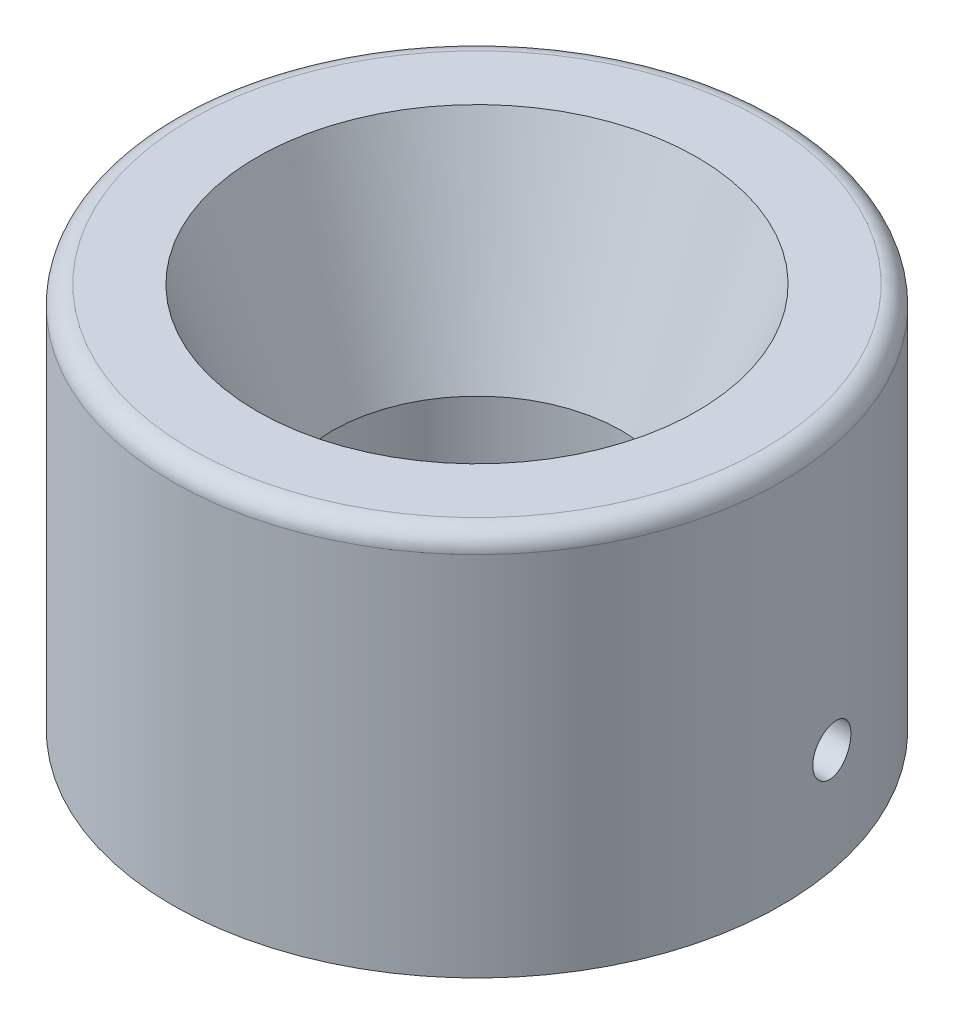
ISO-10303-21;
HEADER;
FILE_DESCRIPTION(('STEP AP214'),'2;1');
FILE_NAME('part.step','',(''),(''),'','','');
FILE_SCHEMA(('AUTOMOTIVE_DESIGN { 1 0 10303 214 1 1 1 1 }'));
ENDSEC;
DATA;
#1=APPLICATION_CONTEXT('core data for automotive mechanical design processes');
#2=APPLICATION_PROTOCOL_DEFINITION('international standard','automotive_design',2000,#1);
#3=PRODUCT_CONTEXT('',#1,'mechanical');
#4=PRODUCT('Part','Part','',(#3));
#5=PRODUCT_RELATED_PRODUCT_CATEGORY('part','',(#4));
#6=PRODUCT_DEFINITION_FORMATION('','',#4);
#7=PRODUCT_DEFINITION_CONTEXT('part definition',#1,'design');
#8=PRODUCT_DEFINITION('design','',#6,#7);
#9=PRODUCT_DEFINITION_SHAPE('','',#8);
#10=(LENGTH_UNIT() NAMED_UNIT(*) SI_UNIT(.MILLI.,.METRE.));
#11=(NAMED_UNIT(*) PLANE_ANGLE_UNIT() SI_UNIT($,.RADIAN.));
#12=(NAMED_UNIT(*) SI_UNIT($,.STERADIAN.) SOLID_ANGLE_UNIT());
#13=UNCERTAINTY_MEASURE_WITH_UNIT(LENGTH_MEASURE(1.E-05),#10,'distance_accuracy_value','');
#14=(GEOMETRIC_REPRESENTATION_CONTEXT(3) GLOBAL_UNCERTAINTY_ASSIGNED_CONTEXT((#13)) GLOBAL_UNIT_ASSIGNED_CONTEXT((#10,
#11,#12)) REPRESENTATION_CONTEXT('',''));
#15=CARTESIAN_POINT('',(0.,0.,0.));
#16=DIRECTION('',(0.,0.,1.));
#17=DIRECTION('',(1.,0.,0.));
#18=AXIS2_PLACEMENT_3D('',#15,#16,#17);
#19=CARTESIAN_POINT('',(0.,0.,0.));
#20=DIRECTION('',(0.,-1.,0.));
#21=DIRECTION('',(0.,0.,-1.));
#22=AXIS2_PLACEMENT_3D('',#19,#20,#21);
#23=CYLINDRICAL_SURFACE('',#22,19.558);
#24=CARTESIAN_POINT('',(-15.24,35.6372317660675,12.2579673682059));
#25=CARTESIAN_POINT('',(-15.275833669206,35.6817789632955,12.2134162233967));
#26=CARTESIAN_POINT('',(-15.3122318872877,35.724762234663,12.1677637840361));
#27=CARTESIAN_POINT('',(-15.386156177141,35.8070765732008,12.0741508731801));
#28=CARTESIAN_POINT('',(-15.4236818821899,35.8464088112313,12.0261911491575));
#29=CARTESIAN_POINT('',(-15.4998790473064,35.9206739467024,11.9278238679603));
#30=CARTESIAN_POINT('',(-15.5385502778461,35.955607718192,11.8774167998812));
#31=CARTESIAN_POINT('',(-15.6170205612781,36.0198555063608,11.7740495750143));
#32=CARTESIAN_POINT('',(-15.6568182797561,36.0491758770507,11.7210923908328));
#33=CARTESIAN_POINT('',(-15.7378880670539,36.1004954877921,11.6120143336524));
#34=CARTESIAN_POINT('',(-15.7791679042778,36.1224469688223,11.5558754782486));
#35=CARTESIAN_POINT('',(-15.8416668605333,36.1468249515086,11.46988252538));
#36=CARTESIAN_POINT('',(-15.8625432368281,36.1535198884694,11.4409955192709));
#37=CARTESIAN_POINT('',(-15.9044109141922,36.1633372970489,11.3827219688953));
#38=CARTESIAN_POINT('',(-15.9254020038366,36.1664649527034,11.353336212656));
#39=CARTESIAN_POINT('',(-15.9633788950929,36.167995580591,11.2998568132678));
#40=CARTESIAN_POINT('',(-15.9803798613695,36.1671725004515,11.2758008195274));
#41=CARTESIAN_POINT('',(-16.0141060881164,36.1618028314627,11.2278505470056));
#42=CARTESIAN_POINT('',(-16.0308312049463,36.1572543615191,11.2039563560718));
#43=CARTESIAN_POINT('',(-16.063798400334,36.1435705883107,11.1566385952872));
#44=CARTESIAN_POINT('',(-16.08003193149,36.1343791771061,11.1332245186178));
#45=CARTESIAN_POINT('',(-16.1111132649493,36.1107570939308,11.0881981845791));
#46=CARTESIAN_POINT('',(-16.1259641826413,36.0963385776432,11.0665818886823));
#47=CARTESIAN_POINT('',(-16.1522103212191,36.0639189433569,11.0282345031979));
#48=CARTESIAN_POINT('',(-16.1638006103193,36.0463966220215,11.0112334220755));
#49=CARTESIAN_POINT('',(-16.1848282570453,36.0077211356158,10.9803028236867));
#50=CARTESIAN_POINT('',(-16.1942642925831,35.9865657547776,10.9663751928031));
#51=CARTESIAN_POINT('',(-16.2116084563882,35.9396172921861,10.9407211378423));
#52=CARTESIAN_POINT('',(-16.2193022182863,35.9135780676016,10.9293062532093));
#53=CARTESIAN_POINT('',(-16.2322142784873,35.8596240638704,10.9101198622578));
#54=CARTESIAN_POINT('',(-16.2374284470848,35.831706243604,10.9023544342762));
#55=CARTESIAN_POINT('',(-16.2481412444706,35.7586936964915,10.8863867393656));
#56=CARTESIAN_POINT('',(-16.2521030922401,35.7128911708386,10.8804656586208));
#57=CARTESIAN_POINT('',(-16.2562691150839,35.6207604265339,10.8742394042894));
#58=CARTESIAN_POINT('',(-16.2564626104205,35.5744310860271,10.8739501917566));
#59=CARTESIAN_POINT('',(-16.2540693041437,35.4815906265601,10.8775272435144));
#60=CARTESIAN_POINT('',(-16.2514553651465,35.4350821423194,10.8814340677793));
#61=CARTESIAN_POINT('',(-16.2440737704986,35.3426023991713,10.892450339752));
#62=CARTESIAN_POINT('',(-16.2393038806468,35.2966317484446,10.8995631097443));
#63=CARTESIAN_POINT('',(-16.2224476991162,35.1595786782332,10.9246491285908));
#64=CARTESIAN_POINT('',(-16.2078218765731,35.0695016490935,10.9463595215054));
#65=CARTESIAN_POINT('',(-16.1709055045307,34.8763687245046,11.0008384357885));
#66=CARTESIAN_POINT('',(-16.1477121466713,34.7738714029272,11.0348899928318));
#67=CARTESIAN_POINT('',(-16.096457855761,34.5724403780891,11.1095214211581));
#68=CARTESIAN_POINT('',(-16.0683909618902,34.473511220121,11.1501092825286));
#69=CARTESIAN_POINT('',(-16.0081386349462,34.2789483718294,11.2364425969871));
#70=CARTESIAN_POINT('',(-15.9759436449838,34.1833230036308,11.2821999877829));
#71=CARTESIAN_POINT('',(-15.9078772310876,33.9955725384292,11.3779726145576));
#72=CARTESIAN_POINT('',(-15.8720052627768,33.9034479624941,11.4279884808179));
#73=CARTESIAN_POINT('',(-15.790836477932,33.7086854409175,11.5399459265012));
#74=CARTESIAN_POINT('',(-15.7449436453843,33.6066624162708,11.60252807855));
#75=CARTESIAN_POINT('',(-15.6483450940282,33.4079685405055,11.7324859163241));
#76=CARTESIAN_POINT('',(-15.5976358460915,33.3113016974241,11.7998651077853));
#77=CARTESIAN_POINT('',(-15.4911808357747,33.1246051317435,11.9392783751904));
#78=CARTESIAN_POINT('',(-15.4354459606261,33.0345617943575,12.0113022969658));
#79=CARTESIAN_POINT('',(-15.3475487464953,32.9058508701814,12.1231328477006));
#80=CARTESIAN_POINT('',(-15.317549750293,32.8640253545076,12.1610224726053));
#81=CARTESIAN_POINT('',(-15.2559860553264,32.7828673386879,12.238165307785));
#82=CARTESIAN_POINT('',(-15.2244218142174,32.7435341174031,12.2774181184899));
#83=CARTESIAN_POINT('',(-15.1648902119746,32.6740925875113,12.3508429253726));
#84=CARTESIAN_POINT('',(-15.1371813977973,32.64352901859,12.3847930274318));
#85=CARTESIAN_POINT('',(-15.080465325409,32.5849730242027,12.4537915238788));
#86=CARTESIAN_POINT('',(-15.0514586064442,32.5569795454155,12.4888394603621));
#87=CARTESIAN_POINT('',(-14.9921538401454,32.5042968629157,12.5599690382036));
#88=CARTESIAN_POINT('',(-14.9618621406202,32.4795934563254,12.5960453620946));
#89=CARTESIAN_POINT('',(-14.8997806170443,32.4342650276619,12.6694201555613));
#90=CARTESIAN_POINT('',(-14.8679924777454,32.4136355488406,12.7067172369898));
#91=CARTESIAN_POINT('',(-14.8101231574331,32.3818027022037,12.7740801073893));
#92=CARTESIAN_POINT('',(-14.7843541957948,32.3695230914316,12.8038991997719));
#93=CARTESIAN_POINT('',(-14.7318630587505,32.3491542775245,12.8642595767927));
#94=CARTESIAN_POINT('',(-14.7051395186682,32.3410713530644,12.8948018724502));
#95=CARTESIAN_POINT('',(-14.6506594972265,32.3303507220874,12.9566684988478));
#96=CARTESIAN_POINT('',(-14.6228944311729,32.3277800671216,12.9879978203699));
#97=CARTESIAN_POINT('',(-14.5672944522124,32.3300664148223,13.0503264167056));
#98=CARTESIAN_POINT('',(-14.5394601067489,32.334897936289,13.0813264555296));
#99=CARTESIAN_POINT('',(-14.494066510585,32.3505524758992,13.1315704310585));
#100=CARTESIAN_POINT('',(-14.4761707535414,32.3588461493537,13.1512931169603));
#101=CARTESIAN_POINT('',(-14.441484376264,32.3797590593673,13.1893727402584));
#102=CARTESIAN_POINT('',(-14.4246927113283,32.3923741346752,13.2077309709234));
#103=CARTESIAN_POINT('',(-14.3927650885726,32.4218373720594,13.2425163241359));
#104=CARTESIAN_POINT('',(-14.3776339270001,32.4386973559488,13.2589378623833));
#105=CARTESIAN_POINT('',(-14.3495407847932,32.4760403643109,13.2893368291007));
#106=CARTESIAN_POINT('',(-14.3365803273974,32.4965259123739,13.3033125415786));
#107=CARTESIAN_POINT('',(-14.3107351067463,32.5445372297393,13.331116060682));
#108=CARTESIAN_POINT('',(-14.2983577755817,32.5726569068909,13.344383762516));
#109=CARTESIAN_POINT('',(-14.2768620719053,32.6314604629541,13.367378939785));
#110=CARTESIAN_POINT('',(-14.2677494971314,32.6621487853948,13.3771001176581));
#111=CARTESIAN_POINT('',(-14.2484922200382,32.7410692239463,13.3976165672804));
#112=CARTESIAN_POINT('',(-14.2401977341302,32.7902559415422,13.4064242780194));
#113=CARTESIAN_POINT('',(-14.2287540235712,32.889863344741,13.4185685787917));
#114=CARTESIAN_POINT('',(-14.2256177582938,32.9402868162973,13.421891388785));
#115=CARTESIAN_POINT('',(-14.2234620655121,33.0365592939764,13.4241756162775));
#116=CARTESIAN_POINT('',(-14.2240854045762,33.0823955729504,13.4235154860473));
#117=CARTESIAN_POINT('',(-14.2280113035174,33.1738366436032,13.4193541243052));
#118=CARTESIAN_POINT('',(-14.2313160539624,33.219441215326,13.4158505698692));
#119=CARTESIAN_POINT('',(-14.2445455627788,33.3556847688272,13.4018079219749));
#120=CARTESIAN_POINT('',(-14.2577855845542,33.4456403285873,13.3877367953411));
#121=CARTESIAN_POINT('',(-14.2900614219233,33.6197946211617,13.353278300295));
#122=CARTESIAN_POINT('',(-14.3088812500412,33.704084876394,13.3331258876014));
#123=CARTESIAN_POINT('',(-14.3511854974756,33.8701006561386,13.2875809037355));
#124=CARTESIAN_POINT('',(-14.3746739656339,33.9518238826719,13.262183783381));
#125=CARTESIAN_POINT('',(-14.4254795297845,34.1126778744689,13.2069041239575));
#126=CARTESIAN_POINT('',(-14.4528037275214,34.1918034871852,13.1770132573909));
#127=CARTESIAN_POINT('',(-14.5106480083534,34.3472569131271,13.1132876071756));
#128=CARTESIAN_POINT('',(-14.5411688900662,34.4235840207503,13.0794518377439));
#129=CARTESIAN_POINT('',(-14.6192278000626,34.6068598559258,12.9922411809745));
#130=CARTESIAN_POINT('',(-14.6682716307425,34.7122363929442,12.9368956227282));
#131=CARTESIAN_POINT('',(-14.7711884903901,34.9166420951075,12.8192617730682));
#132=CARTESIAN_POINT('',(-14.8250646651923,35.0156670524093,12.7569689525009));
#133=CARTESIAN_POINT('',(-14.936956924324,35.2066280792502,12.6257717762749));
#134=CARTESIAN_POINT('',(-14.9949700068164,35.2985691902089,12.5568722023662));
#135=CARTESIAN_POINT('',(-15.1147328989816,35.4743843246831,12.4124539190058));
#136=CARTESIAN_POINT('',(-15.1764794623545,35.5582651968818,12.3369409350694));
#137=CARTESIAN_POINT('',(-15.24,35.6372317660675,12.2579673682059));
#138=B_SPLINE_CURVE_WITH_KNOTS('',3,(#24,#25,#26,#27,#28,#29,#30,#31,#32,#33,#34,#35,#36,#37,
#38,#39,#40,#41,#42,#43,#44,#45,#46,#47,#48,#49,#50,#51,#52,#53,#54,#55,#56,#57,#58,#59,#60,#61,
#62,#63,#64,#65,#66,#67,#68,#69,#70,#71,#72,#73,#74,#75,#76,#77,#78,#79,#80,#81,#82,#83,#84,#85,
#86,#87,#88,#89,#90,#91,#92,#93,#94,#95,#96,#97,#98,#99,#100,#101,#102,#103,#104,#105,#106,#107,
#108,#109,#110,#111,#112,#113,#114,#115,#116,#117,#118,#119,#120,#121,#122,#123,#124,#125,#126,
#127,#128,#129,#130,#131,#132,#133,#134,#135,#136,#137),.UNSPECIFIED.,.T.,.F.,(4,2,2,2,2,2,2,2,
2,2,2,2,2,2,2,2,2,2,2,2,2,2,2,2,2,2,2,2,2,2,2,2,2,2,2,2,2,2,2,2,2,2,2,2,2,2,2,2,2,2,2,2,2,2,2,2,
4),(0.,0.217395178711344,0.434720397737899,0.652002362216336,0.869036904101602,1.08745208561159,
1.19611530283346,1.30462040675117,1.39284107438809,1.4811063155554,1.57046467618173,
1.65961655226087,1.74018199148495,1.8207967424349,1.9086773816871,1.99670387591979,
2.13498068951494,2.27364933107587,2.41367054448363,2.55383719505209,2.83460767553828,
3.16557236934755,3.4969447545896,3.82909863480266,4.16130176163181,4.54556577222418,
4.93011354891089,5.31384740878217,5.50552488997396,5.69714665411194,5.857357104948,
6.01750159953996,6.17693066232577,6.33618433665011,6.45984789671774,6.5836959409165,
6.70904212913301,6.83395779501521,6.91729806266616,7.0005583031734,7.08405303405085,
7.16760611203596,7.26744960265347,7.36746953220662,7.51857728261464,7.67006409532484,
7.80739859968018,7.94484541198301,8.22007536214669,8.4857986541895,8.75175340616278,
9.01820722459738,9.28472776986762,9.67044823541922,10.0564216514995,10.4421177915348,
10.8274832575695),.UNSPECIFIED.);
#139=CARTESIAN_POINT('',(-15.24,35.6372317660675,12.2579673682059));
#140=VERTEX_POINT('',#139);
#141=EDGE_CURVE('E200',#140,#140,#138,.T.);
#142=ORIENTED_EDGE('',*,*,#141,.T.);
#143=EDGE_LOOP('',(#142));
#144=FACE_BOUND('',#143,.T.);
#145=CARTESIAN_POINT('',(15.24,32.7635498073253,-12.2579673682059));
#146=CARTESIAN_POINT('',(15.2126440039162,32.7295399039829,-12.2919782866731));
#147=CARTESIAN_POINT('',(15.1846738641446,32.6965541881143,-12.3265200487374));
#148=CARTESIAN_POINT('',(15.1273843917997,32.6330315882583,-12.3967600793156));
#149=CARTESIAN_POINT('',(15.0980646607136,32.6024954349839,-12.4324586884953));
#150=CARTESIAN_POINT('',(15.038100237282,32.5445954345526,-12.504923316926));
#151=CARTESIAN_POINT('',(15.0074622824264,32.5172176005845,-12.5416836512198));
#152=CARTESIAN_POINT('',(14.9446279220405,32.4663159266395,-12.6164909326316));
#153=CARTESIAN_POINT('',(14.9124329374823,32.4427886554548,-12.6545366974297));
#154=CARTESIAN_POINT('',(14.8521163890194,32.4044683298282,-12.7252414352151));
#155=CARTESIAN_POINT('',(14.8242616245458,32.3888677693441,-12.7576849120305));
#156=CARTESIAN_POINT('',(14.7673405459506,32.3621521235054,-12.8235296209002));
#157=CARTESIAN_POINT('',(14.7382719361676,32.35104600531,-12.8569326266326));
#158=CARTESIAN_POINT('',(14.6787441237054,32.3347637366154,-12.9248559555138));
#159=CARTESIAN_POINT('',(14.6482714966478,32.3296691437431,-12.9593852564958));
#160=CARTESIAN_POINT('',(14.5869738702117,32.327929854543,-13.0283403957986));
#161=CARTESIAN_POINT('',(14.5561509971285,32.3312482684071,-13.0627660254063));
#162=CARTESIAN_POINT('',(14.5074106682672,32.3452922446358,-13.1168278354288));
#163=CARTESIAN_POINT('',(14.4891334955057,32.3526375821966,-13.1370117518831));
#164=CARTESIAN_POINT('',(14.4535607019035,32.3717179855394,-13.1761391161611));
#165=CARTESIAN_POINT('',(14.4362641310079,32.3834487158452,-13.1950837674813));
#166=CARTESIAN_POINT('',(14.4032068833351,32.4113299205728,-13.2311601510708));
#167=CARTESIAN_POINT('',(14.3874527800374,32.4274982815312,-13.248284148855));
#168=CARTESIAN_POINT('',(14.3580901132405,32.4637139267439,-13.2801010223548));
#169=CARTESIAN_POINT('',(14.3444825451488,32.4837630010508,-13.2947927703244));
#170=CARTESIAN_POINT('',(14.3202383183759,32.5259122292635,-13.3209024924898));
#171=CARTESIAN_POINT('',(14.309496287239,32.5478811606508,-13.3324371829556));
#172=CARTESIAN_POINT('',(14.2902027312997,32.5937952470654,-13.3531145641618));
#173=CARTESIAN_POINT('',(14.2816520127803,32.6177411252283,-13.3622563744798));
#174=CARTESIAN_POINT('',(14.2615953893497,32.6832532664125,-13.3836693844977));
#175=CARTESIAN_POINT('',(14.2518772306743,32.7259955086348,-13.3940093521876));
#176=CARTESIAN_POINT('',(14.2370385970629,32.8131580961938,-13.409780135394));
#177=CARTESIAN_POINT('',(14.2319332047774,32.8575834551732,-13.4151948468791));
#178=CARTESIAN_POINT('',(14.2229532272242,32.9800807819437,-13.4247180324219));
#179=CARTESIAN_POINT('',(14.2227896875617,33.0587073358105,-13.4248899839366));
#180=CARTESIAN_POINT('',(14.230095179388,33.2151139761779,-13.4171441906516));
#181=CARTESIAN_POINT('',(14.23758208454,33.2928916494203,-13.409207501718));
#182=CARTESIAN_POINT('',(14.2578734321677,33.4444175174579,-13.3876294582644));
#183=CARTESIAN_POINT('',(14.2705073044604,33.5182160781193,-13.3741710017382));
#184=CARTESIAN_POINT('',(14.299922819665,33.6640268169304,-13.3427146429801));
#185=CARTESIAN_POINT('',(14.3167081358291,33.7360373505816,-13.3247127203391));
#186=CARTESIAN_POINT('',(14.3536800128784,33.8782450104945,-13.2848776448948));
#187=CARTESIAN_POINT('',(14.3738732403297,33.9484382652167,-13.2630369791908));
#188=CARTESIAN_POINT('',(14.4170954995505,34.0868215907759,-13.216041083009));
#189=CARTESIAN_POINT('',(14.4401254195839,34.1550110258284,-13.1908848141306));
#190=CARTESIAN_POINT('',(14.5044377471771,34.3331850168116,-13.1202205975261));
#191=CARTESIAN_POINT('',(14.5478232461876,34.441402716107,-13.0721452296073));
#192=CARTESIAN_POINT('',(14.6399652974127,34.6520514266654,-12.9688696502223));
#193=CARTESIAN_POINT('',(14.688725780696,34.7544781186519,-12.9136642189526));
#194=CARTESIAN_POINT('',(14.790740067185,34.9530612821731,-12.7966945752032));
#195=CARTESIAN_POINT('',(14.8439909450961,35.0492217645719,-12.7349346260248));
#196=CARTESIAN_POINT('',(14.9544070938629,35.2346597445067,-12.6050916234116));
#197=CARTESIAN_POINT('',(15.0115698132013,35.3239416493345,-12.5370126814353));
#198=CARTESIAN_POINT('',(15.1372386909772,35.5059553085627,-12.3850849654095));
#199=CARTESIAN_POINT('',(15.2062499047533,35.5976070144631,-12.3003386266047));
#200=CARTESIAN_POINT('',(15.312974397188,35.7255489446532,-12.166816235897));
#201=CARTESIAN_POINT('',(15.3490664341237,35.7665902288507,-12.1212641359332));
#202=CARTESIAN_POINT('',(15.4223354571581,35.8449380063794,-12.0279031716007));
#203=CARTESIAN_POINT('',(15.4595120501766,35.8822458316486,-11.9800951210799));
#204=CARTESIAN_POINT('',(15.5419568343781,35.9588302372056,-11.8730076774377));
#205=CARTESIAN_POINT('',(15.5874531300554,35.9972015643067,-11.8132384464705));
#206=CARTESIAN_POINT('',(15.6568580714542,36.0482607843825,-11.7209061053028));
#207=CARTESIAN_POINT('',(15.6801804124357,36.0641943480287,-11.6896904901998));
#208=CARTESIAN_POINT('',(15.7272101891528,36.0934314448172,-11.626339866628));
#209=CARTESIAN_POINT('',(15.7509174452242,36.1067361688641,-11.5942052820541));
#210=CARTESIAN_POINT('',(15.8025444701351,36.1319792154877,-11.5237647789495));
#211=CARTESIAN_POINT('',(15.8305279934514,36.1433527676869,-11.485298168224));
#212=CARTESIAN_POINT('',(15.8868346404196,36.160235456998,-11.4072849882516));
#213=CARTESIAN_POINT('',(15.9151573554,36.1657510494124,-11.3677396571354));
#214=CARTESIAN_POINT('',(15.9629759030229,36.1681621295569,-11.3004384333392));
#215=CARTESIAN_POINT('',(15.9825070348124,36.167187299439,-11.2727978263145));
#216=CARTESIAN_POINT('',(16.0211391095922,36.1602359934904,-11.2178244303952));
#217=CARTESIAN_POINT('',(16.0402407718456,36.1542686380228,-11.1904911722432));
#218=CARTESIAN_POINT('',(16.072849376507,36.1384000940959,-11.1435849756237));
#219=CARTESIAN_POINT('',(16.0865886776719,36.1298057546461,-11.1237391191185));
#220=CARTESIAN_POINT('',(16.113008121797,36.1087561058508,-11.0854351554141));
#221=CARTESIAN_POINT('',(16.1256895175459,36.0963054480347,-11.0669754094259));
#222=CARTESIAN_POINT('',(16.1495902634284,36.0674677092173,-11.0320691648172));
#223=CARTESIAN_POINT('',(16.1608008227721,36.0510584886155,-11.0156348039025));
#224=CARTESIAN_POINT('',(16.1812875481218,36.014852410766,-10.985519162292));
#225=CARTESIAN_POINT('',(16.1905629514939,35.9950542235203,-10.9718389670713));
#226=CARTESIAN_POINT('',(16.2064138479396,35.9545410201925,-10.9484108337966));
#227=CARTESIAN_POINT('',(16.2131406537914,35.934009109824,-10.938443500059));
#228=CARTESIAN_POINT('',(16.2249091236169,35.8914832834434,-10.9209796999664));
#229=CARTESIAN_POINT('',(16.2299502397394,35.8694888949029,-10.9134840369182));
#230=CARTESIAN_POINT('',(16.2416151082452,35.8084411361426,-10.8961224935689));
#231=CARTESIAN_POINT('',(16.2467697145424,35.7684951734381,-10.8884288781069));
#232=CARTESIAN_POINT('',(16.2536794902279,35.6876520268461,-10.878110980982));
#233=CARTESIAN_POINT('',(16.2554223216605,35.6467519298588,-10.8755050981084));
#234=CARTESIAN_POINT('',(16.2563121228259,35.5667858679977,-10.8741748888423));
#235=CARTESIAN_POINT('',(16.255575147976,35.5277223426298,-10.875277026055));
#236=CARTESIAN_POINT('',(16.2522702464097,35.4498332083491,-10.8802152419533));
#237=CARTESIAN_POINT('',(16.2497005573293,35.4110078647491,-10.8840539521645));
#238=CARTESIAN_POINT('',(16.2398061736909,35.2950482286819,-10.8988164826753));
#239=CARTESIAN_POINT('',(16.2302970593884,35.2185209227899,-10.9129853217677));
#240=CARTESIAN_POINT('',(16.2053907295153,35.0550668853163,-10.9499427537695));
#241=CARTESIAN_POINT('',(16.1892819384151,34.9685019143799,-10.9737663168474));
#242=CARTESIAN_POINT('',(16.1530588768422,34.7979006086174,-11.0270165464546));
#243=CARTESIAN_POINT('',(16.1329397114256,34.7138675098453,-11.0564500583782));
#244=CARTESIAN_POINT('',(16.089403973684,34.5479996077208,-11.1197088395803));
#245=CARTESIAN_POINT('',(16.0659756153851,34.4661739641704,-11.1535497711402));
#246=CARTESIAN_POINT('',(16.0163313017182,34.304992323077,-11.2247218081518));
#247=CARTESIAN_POINT('',(15.9901167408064,34.2256351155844,-11.2620511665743));
#248=CARTESIAN_POINT('',(15.916515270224,34.016331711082,-11.3660138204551));
#249=CARTESIAN_POINT('',(15.8668171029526,33.8885383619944,-11.4353655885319));
#250=CARTESIAN_POINT('',(15.7606251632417,33.6398579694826,-11.5812882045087));
#251=CARTESIAN_POINT('',(15.7041232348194,33.5189794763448,-11.6578676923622));
#252=CARTESIAN_POINT('',(15.6142012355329,33.344016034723,-11.7777148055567));
#253=CARTESIAN_POINT('',(15.5834055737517,33.2868184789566,-11.8184418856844));
#254=CARTESIAN_POINT('',(15.5199809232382,33.1747371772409,-11.9016087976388));
#255=CARTESIAN_POINT('',(15.4873522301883,33.1198530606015,-11.9440483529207));
#256=CARTESIAN_POINT('',(15.4201867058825,33.0128250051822,-12.0306360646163));
#257=CARTESIAN_POINT('',(15.3856528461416,32.9606770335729,-12.0747815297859));
#258=CARTESIAN_POINT('',(15.3144701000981,32.8595508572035,-12.1649360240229));
#259=CARTESIAN_POINT('',(15.2778220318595,32.8105714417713,-12.2109443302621));
#260=CARTESIAN_POINT('',(15.24,32.7635498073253,-12.2579673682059));
#261=B_SPLINE_CURVE_WITH_KNOTS('',3,(#145,#146,#147,#148,#149,#150,#151,#152,#153,#154,#155,
#156,#157,#158,#159,#160,#161,#162,#163,#164,#165,#166,#167,#168,#169,#170,#171,#172,#173,#174,
#175,#176,#177,#178,#179,#180,#181,#182,#183,#184,#185,#186,#187,#188,#189,#190,#191,#192,#193,
#194,#195,#196,#197,#198,#199,#200,#201,#202,#203,#204,#205,#206,#207,#208,#209,#210,#211,#212,
#213,#214,#215,#216,#217,#218,#219,#220,#221,#222,#223,#224,#225,#226,#227,#228,#229,#230,#231,
#232,#233,#234,#235,#236,#237,#238,#239,#240,#241,#242,#243,#244,#245,#246,#247,#248,#249,#250,
#251,#252,#253,#254,#255,#256,#257,#258,#259,#260),.UNSPECIFIED.,.T.,.F.,(4,2,2,2,2,2,2,2,2,2,2,
2,2,2,2,2,2,2,2,2,2,2,2,2,2,2,2,2,2,2,2,2,2,2,2,2,2,2,2,2,2,2,2,2,2,2,2,2,2,2,2,2,2,2,2,2,2,4),
(0.,0.165979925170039,0.332009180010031,0.497272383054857,0.662387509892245,0.798753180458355,
0.935389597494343,1.07385917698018,1.2117226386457,1.29600278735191,1.38019983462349,
1.46474136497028,1.54932198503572,1.63013331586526,1.71097433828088,1.84530097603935,
1.98006525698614,2.2146246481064,2.44973329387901,2.6776133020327,2.90569566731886,
3.13422949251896,3.36283506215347,3.74063528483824,4.11871367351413,4.49654763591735,
4.87413746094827,5.30118799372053,5.51451632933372,5.72776828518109,5.98033847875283,
6.1065596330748,6.23272347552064,6.3791976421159,6.52551023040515,6.62681676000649,
6.72793862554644,6.80450917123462,6.88098771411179,6.95790433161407,7.03485120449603,
7.10596831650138,7.17710851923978,7.29941109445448,7.42215513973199,7.53923614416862,
7.65642988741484,7.89108662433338,8.16437007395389,8.43798915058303,8.71260854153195,
8.98709113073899,9.44754258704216,9.90855160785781,10.138507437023,10.3684262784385,
10.5979961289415,10.827477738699),.UNSPECIFIED.);
#262=CARTESIAN_POINT('',(15.24,32.7635498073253,-12.2579673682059));
#263=VERTEX_POINT('',#262);
#264=EDGE_CURVE('E193',#263,#263,#261,.T.);
#265=ORIENTED_EDGE('',*,*,#264,.T.);
#266=EDGE_LOOP('',(#265));
#267=FACE_BOUND('',#266,.T.);
#268=CARTESIAN_POINT('',(0.,37.846,0.));
#269=DIRECTION('',(0.,-1.,0.));
#270=DIRECTION('',(0.,0.,-1.));
#271=AXIS2_PLACEMENT_3D('',#268,#269,#270);
#272=CIRCLE('',#271,19.558);
#273=CARTESIAN_POINT('',(0.,37.846,-19.558));
#274=VERTEX_POINT('',#273);
#275=EDGE_CURVE('E311',#274,#274,#272,.T.);
#276=ORIENTED_EDGE('',*,*,#275,.F.);
#277=EDGE_LOOP('',(#276));
#278=FACE_BOUND('',#277,.T.);
#279=CARTESIAN_POINT('',(0.,12.7,0.));
#280=DIRECTION('',(0.,-1.,0.));
#281=DIRECTION('',(0.,0.,-1.));
#282=AXIS2_PLACEMENT_3D('',#279,#280,#281);
#283=CIRCLE('',#282,19.558);
#284=CARTESIAN_POINT('',(0.,12.7,-19.558));
#285=VERTEX_POINT('',#284);
#286=EDGE_CURVE('E324',#285,#285,#283,.F.);
#287=ORIENTED_EDGE('',*,*,#286,.F.);
#288=EDGE_LOOP('',(#287));
#289=FACE_BOUND('',#288,.T.);
#290=ADVANCED_FACE('F42',(#144,#267,#278,#289),#23,.F.);
#291=CARTESIAN_POINT('',(0.,0.,0.));
#292=DIRECTION('',(0.,-1.,0.));
#293=DIRECTION('',(0.,0.,-1.));
#294=AXIS2_PLACEMENT_3D('',#291,#292,#293);
#295=CYLINDRICAL_SURFACE('',#294,41.148);
#296=CARTESIAN_POINT('',(0.,62.23,0.));
#297=DIRECTION('',(0.,-1.,0.));
#298=DIRECTION('',(0.,0.,-1.));
#299=AXIS2_PLACEMENT_3D('',#296,#297,#298);
#300=CIRCLE('',#299,41.148);
#301=CARTESIAN_POINT('',(0.,62.23,-41.148));
#302=VERTEX_POINT('',#301);
#303=EDGE_CURVE('E51',#302,#302,#300,.T.);
#304=ORIENTED_EDGE('',*,*,#303,.T.);
#305=EDGE_LOOP('',(#304));
#306=FACE_BOUND('',#305,.T.);
#307=CARTESIAN_POINT('',(39.706748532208,26.67,-10.795));
#308=CARTESIAN_POINT('',(39.7067518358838,26.4958959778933,-10.794991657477));
#309=CARTESIAN_POINT('',(39.7106658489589,26.3216692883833,-10.7806229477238));
#310=CARTESIAN_POINT('',(39.7261019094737,25.9781246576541,-10.7235985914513));
#311=CARTESIAN_POINT('',(39.7376328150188,25.8088126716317,-10.6809100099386));
#312=CARTESIAN_POINT('',(39.7676094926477,25.4802159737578,-10.5687502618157));
#313=CARTESIAN_POINT('',(39.786045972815,25.3209181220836,-10.4993150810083));
#314=CARTESIAN_POINT('',(39.8288127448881,25.0163916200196,-10.3358927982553));
#315=CARTESIAN_POINT('',(39.8531422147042,24.8711610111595,-10.241909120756));
#316=CARTESIAN_POINT('',(39.9069293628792,24.5959400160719,-10.0303033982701));
#317=CARTESIAN_POINT('',(39.9364705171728,24.4662664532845,-9.91229083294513));
#318=CARTESIAN_POINT('',(39.9989510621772,24.2284014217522,-9.65707279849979));
#319=CARTESIAN_POINT('',(40.0318910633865,24.1202138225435,-9.51986387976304));
#320=CARTESIAN_POINT('',(40.1007731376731,23.9249659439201,-9.22547587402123));
#321=CARTESIAN_POINT('',(40.136776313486,23.8386558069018,-9.06781320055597));
#322=CARTESIAN_POINT('',(40.2093631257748,23.6938310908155,-8.74031677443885));
#323=CARTESIAN_POINT('',(40.24594682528,23.6353195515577,-8.57048169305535));
#324=CARTESIAN_POINT('',(40.3189230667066,23.5469774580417,-8.22038971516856));
#325=CARTESIAN_POINT('',(40.3553028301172,23.517628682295,-8.04000826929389));
#326=CARTESIAN_POINT('',(40.4260285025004,23.4902740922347,-7.67648383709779));
#327=CARTESIAN_POINT('',(40.460374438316,23.4922678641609,-7.4933408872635));
#328=CARTESIAN_POINT('',(40.5259153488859,23.5277107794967,-7.13035505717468));
#329=CARTESIAN_POINT('',(40.5571231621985,23.5610254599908,-6.9505014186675));
#330=CARTESIAN_POINT('',(40.6158577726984,23.6582359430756,-6.59862335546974));
#331=CARTESIAN_POINT('',(40.64338486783,23.7221292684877,-6.42659829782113));
#332=CARTESIAN_POINT('',(40.6939484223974,23.8776592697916,-6.09817054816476));
#333=CARTESIAN_POINT('',(40.7170474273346,23.9688542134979,-5.94156830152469));
#334=CARTESIAN_POINT('',(40.7591140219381,24.1768542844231,-5.64578392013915));
#335=CARTESIAN_POINT('',(40.7780819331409,24.2936574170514,-5.50660042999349));
#336=CARTESIAN_POINT('',(40.8116839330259,24.5477689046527,-5.25173233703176));
#337=CARTESIAN_POINT('',(40.8263750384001,24.684766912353,-5.13574571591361));
#338=CARTESIAN_POINT('',(40.8519299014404,24.9765697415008,-4.92835475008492));
#339=CARTESIAN_POINT('',(40.862793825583,25.1313737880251,-4.83694933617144));
#340=CARTESIAN_POINT('',(40.880829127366,25.4531084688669,-4.6820696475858));
#341=CARTESIAN_POINT('',(40.8880280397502,25.6199375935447,-4.6183876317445));
#342=CARTESIAN_POINT('',(40.8990404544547,25.9620048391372,-4.51983118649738));
#343=CARTESIAN_POINT('',(40.9028540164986,26.1372428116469,-4.48495624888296));
#344=CARTESIAN_POINT('',(40.9072046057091,26.4906308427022,-4.44510109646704));
#345=CARTESIAN_POINT('',(40.9077507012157,26.668771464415,-4.44003814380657));
#346=CARTESIAN_POINT('',(40.9056080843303,27.0233761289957,-4.45973377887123));
#347=CARTESIAN_POINT('',(40.9029193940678,27.1998401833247,-4.48449216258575));
#348=CARTESIAN_POINT('',(40.8942262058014,27.5459887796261,-4.56308141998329));
#349=CARTESIAN_POINT('',(40.8882234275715,27.7156767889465,-4.61689721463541));
#350=CARTESIAN_POINT('',(40.8727407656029,28.0435636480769,-4.75200614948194));
#351=CARTESIAN_POINT('',(40.8632608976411,28.201762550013,-4.83329916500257));
#352=CARTESIAN_POINT('',(40.8406153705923,28.5023534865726,-5.02105107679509));
#353=CARTESIAN_POINT('',(40.8274463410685,28.6447308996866,-5.12753297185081));
#354=CARTESIAN_POINT('',(40.7972518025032,28.9095396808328,-5.36247508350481));
#355=CARTESIAN_POINT('',(40.7802262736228,29.0319709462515,-5.49093541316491));
#356=CARTESIAN_POINT('',(40.7421652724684,29.2539555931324,-5.76656397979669));
#357=CARTESIAN_POINT('',(40.7211153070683,29.3534233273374,-5.91379917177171));
#358=CARTESIAN_POINT('',(40.6751182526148,29.5262759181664,-6.22229485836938));
#359=CARTESIAN_POINT('',(40.6501710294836,29.5996598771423,-6.38355583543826));
#360=CARTESIAN_POINT('',(40.5964137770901,29.7190692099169,-6.71698137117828));
#361=CARTESIAN_POINT('',(40.5675708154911,29.7648408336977,-6.88923143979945));
#362=CARTESIAN_POINT('',(40.5067244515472,29.8269716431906,-7.23841036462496));
#363=CARTESIAN_POINT('',(40.4747207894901,29.8433284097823,-7.41533960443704));
#364=CARTESIAN_POINT('',(40.4078307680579,29.8464508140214,-7.77164418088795));
#365=CARTESIAN_POINT('',(40.3729085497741,29.8327717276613,-7.95101666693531));
#366=CARTESIAN_POINT('',(40.3016567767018,29.7754781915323,-8.30463236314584));
#367=CARTESIAN_POINT('',(40.2653270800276,29.7318607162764,-8.47887505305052));
#368=CARTESIAN_POINT('',(40.1920050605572,29.6151142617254,-8.81994939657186));
#369=CARTESIAN_POINT('',(40.1550107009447,29.5415714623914,-8.98663912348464));
#370=CARTESIAN_POINT('',(40.0823773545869,29.3669542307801,-9.30524907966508));
#371=CARTESIAN_POINT('',(40.0467383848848,29.265879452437,-9.45716912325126));
#372=CARTESIAN_POINT('',(39.9784017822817,29.0387337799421,-9.74201203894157));
#373=CARTESIAN_POINT('',(39.945706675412,28.9126417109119,-9.8749186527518));
#374=CARTESIAN_POINT('',(39.8849399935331,28.6388168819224,-10.1175666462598));
#375=CARTESIAN_POINT('',(39.8568690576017,28.4910811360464,-10.2273048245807));
#376=CARTESIAN_POINT('',(39.8074292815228,28.1812630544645,-10.4180624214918));
#377=CARTESIAN_POINT('',(39.7859374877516,28.0195272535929,-10.4996129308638));
#378=CARTESIAN_POINT('',(39.7501942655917,27.6839910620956,-10.634136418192));
#379=CARTESIAN_POINT('',(39.7359324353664,27.5102084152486,-10.6871504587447));
#380=CARTESIAN_POINT('',(39.7194420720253,27.2242958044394,-10.7482259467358));
#381=CARTESIAN_POINT('',(39.7146939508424,27.1142390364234,-10.7657389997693));
#382=CARTESIAN_POINT('',(39.7083461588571,26.8928049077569,-10.7891285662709));
#383=CARTESIAN_POINT('',(39.7067464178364,26.7814275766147,-10.7950053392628));
#384=CARTESIAN_POINT('',(39.706748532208,26.67,-10.795));
#385=B_SPLINE_CURVE_WITH_KNOTS('',3,(#307,#308,#309,#310,#311,#312,#313,#314,#315,#316,#317,
#318,#319,#320,#321,#322,#323,#324,#325,#326,#327,#328,#329,#330,#331,#332,#333,#334,#335,#336,
#337,#338,#339,#340,#341,#342,#343,#344,#345,#346,#347,#348,#349,#350,#351,#352,#353,#354,#355,
#356,#357,#358,#359,#360,#361,#362,#363,#364,#365,#366,#367,#368,#369,#370,#371,#372,#373,#374,
#375,#376,#377,#378,#379,#380,#381,#382,#383,#384),.UNSPECIFIED.,.T.,.F.,(4,2,2,2,2,2,2,2,2,2,2,
2,2,2,2,2,2,2,2,2,2,2,2,2,2,2,2,2,2,2,2,2,2,2,2,2,2,2,4),(0.,0.521897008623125,1.0444020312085,
1.56620649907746,2.0879382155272,2.61894480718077,3.15004694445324,3.69744565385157,
4.24490420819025,4.80126365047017,5.35761574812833,5.91159024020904,6.4655198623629,
7.0109314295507,7.55630053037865,8.09402573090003,8.63172753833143,9.16532773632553,
9.69891852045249,10.2310277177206,10.7631332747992,11.2949629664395,11.8267902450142,
12.3591049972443,12.891422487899,13.4256943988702,13.9599846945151,14.4991130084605,
15.0382856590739,15.5854952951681,16.1327602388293,16.6878651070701,17.2429769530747,
17.7985606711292,18.3542211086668,18.8987543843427,19.4425019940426,19.776526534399,
20.1105436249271),.UNSPECIFIED.);
#386=CARTESIAN_POINT('',(39.706748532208,26.67,-10.795));
#387=VERTEX_POINT('',#386);
#388=EDGE_CURVE('E334',#387,#387,#385,.T.);
#389=ORIENTED_EDGE('',*,*,#388,.T.);
#390=EDGE_LOOP('',(#389));
#391=FACE_BOUND('',#390,.T.);
#392=CARTESIAN_POINT('',(0.,12.7,0.));
#393=DIRECTION('',(0.,-1.,0.));
#394=DIRECTION('',(0.,0.,-1.));
#395=AXIS2_PLACEMENT_3D('',#392,#393,#394);
#396=CIRCLE('',#395,41.148);
#397=CARTESIAN_POINT('',(0.,12.7,-41.148));
#398=VERTEX_POINT('',#397);
#399=EDGE_CURVE('E330',#398,#398,#396,.T.);
#400=ORIENTED_EDGE('',*,*,#399,.F.);
#401=EDGE_LOOP('',(#400));
#402=FACE_BOUND('',#401,.T.);
#403=ADVANCED_FACE('F177',(#306,#391,#402),#295,.T.);
#404=CARTESIAN_POINT('',(0.,37.846,0.));
#405=DIRECTION('',(0.,1.,0.));
#406=DIRECTION('',(0.,0.,1.));
#407=AXIS2_PLACEMENT_3D('',#404,#405,#406);
#408=CONICAL_SURFACE('',#407,19.558,0.360836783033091);
#409=CARTESIAN_POINT('',(0.,64.77,0.));
#410=DIRECTION('',(0.,-1.,0.));
#411=DIRECTION('',(0.,0.,-1.));
#412=AXIS2_PLACEMENT_3D('',#409,#410,#411);
#413=CIRCLE('',#412,29.718);
#414=CARTESIAN_POINT('',(0.,64.77,-29.718));
#415=VERTEX_POINT('',#414);
#416=EDGE_CURVE('E318',#415,#415,#413,.T.);
#417=ORIENTED_EDGE('',*,*,#416,.F.);
#418=EDGE_LOOP('',(#417));
#419=FACE_BOUND('',#418,.T.);
#420=ORIENTED_EDGE('',*,*,#275,.T.);
#421=EDGE_LOOP('',(#420));
#422=FACE_BOUND('',#421,.T.);
#423=ADVANCED_FACE('F183',(#419,#422),#408,.F.);
#424=CARTESIAN_POINT('',(0.,64.77,29.718));
#425=DIRECTION('',(0.,-1.,0.));
#426=DIRECTION('',(0.,0.,-1.));
#427=AXIS2_PLACEMENT_3D('',#424,#425,#426);
#428=PLANE('',#427);
#429=CARTESIAN_POINT('',(0.,64.77,0.));
#430=DIRECTION('',(0.,-1.,0.));
#431=DIRECTION('',(0.,0.,-1.));
#432=AXIS2_PLACEMENT_3D('',#429,#430,#431);
#433=CIRCLE('',#432,38.608);
#434=CARTESIAN_POINT('',(0.,64.77,-38.608));
#435=VERTEX_POINT('',#434);
#436=EDGE_CURVE('E11',#435,#435,#433,.F.);
#437=ORIENTED_EDGE('',*,*,#436,.T.);
#438=EDGE_LOOP('',(#437));
#439=FACE_BOUND('',#438,.T.);
#440=ORIENTED_EDGE('',*,*,#416,.T.);
#441=EDGE_LOOP('',(#440));
#442=FACE_BOUND('',#441,.T.);
#443=ADVANCED_FACE('F342',(#439,#442),#428,.F.);
#444=CARTESIAN_POINT('',(0.,12.7,0.));
#445=DIRECTION('',(0.,-1.,0.));
#446=DIRECTION('',(0.,0.,-1.));
#447=AXIS2_PLACEMENT_3D('',#444,#445,#446);
#448=PLANE('',#447);
#449=CARTESIAN_POINT('',(-30.861,12.7,-14.732));
#450=DIRECTION('',(0.,-1.,0.));
#451=DIRECTION('',(0.,0.,-1.));
#452=AXIS2_PLACEMENT_3D('',#449,#450,#451);
#453=CIRCLE('',#452,2.5527);
#454=CARTESIAN_POINT('',(-30.861,12.7,-17.2847));
#455=VERTEX_POINT('',#454);
#456=EDGE_CURVE('E101',#455,#455,#453,.T.);
#457=ORIENTED_EDGE('',*,*,#456,.F.);
#458=EDGE_LOOP('',(#457));
#459=FACE_BOUND('',#458,.T.);
#460=CARTESIAN_POINT('',(-30.861,12.7,14.732));
#461=DIRECTION('',(0.,-1.,0.));
#462=DIRECTION('',(0.,0.,-1.));
#463=AXIS2_PLACEMENT_3D('',#460,#461,#462);
#464=CIRCLE('',#463,2.5527);
#465=CARTESIAN_POINT('',(-30.861,12.7,12.1793));
#466=VERTEX_POINT('',#465);
#467=EDGE_CURVE('E100',#466,#466,#464,.T.);
#468=ORIENTED_EDGE('',*,*,#467,.F.);
#469=EDGE_LOOP('',(#468));
#470=FACE_BOUND('',#469,.T.);
#471=CARTESIAN_POINT('',(30.861,12.7,14.732));
#472=DIRECTION('',(0.,-1.,0.));
#473=DIRECTION('',(0.,0.,-1.));
#474=AXIS2_PLACEMENT_3D('',#471,#472,#473);
#475=CIRCLE('',#474,2.5527);
#476=CARTESIAN_POINT('',(30.861,12.7,12.1793));
#477=VERTEX_POINT('',#476);
#478=EDGE_CURVE('E115',#477,#477,#475,.T.);
#479=ORIENTED_EDGE('',*,*,#478,.F.);
#480=EDGE_LOOP('',(#479));
#481=FACE_BOUND('',#480,.T.);
#482=CARTESIAN_POINT('',(30.861,12.7,-14.732));
#483=DIRECTION('',(0.,-1.,0.));
#484=DIRECTION('',(0.,0.,-1.));
#485=AXIS2_PLACEMENT_3D('',#482,#483,#484);
#486=CIRCLE('',#485,2.5527);
#487=CARTESIAN_POINT('',(30.861,12.7,-17.2847));
#488=VERTEX_POINT('',#487);
#489=EDGE_CURVE('E123',#488,#488,#486,.T.);
#490=ORIENTED_EDGE('',*,*,#489,.F.);
#491=EDGE_LOOP('',(#490));
#492=FACE_BOUND('',#491,.T.);
#493=CARTESIAN_POINT('',(-15.24,12.7,33.7583581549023));
#494=DIRECTION('',(0.,-1.,0.));
#495=DIRECTION('',(0.,0.,-1.));
#496=AXIS2_PLACEMENT_3D('',#493,#494,#495);
#497=ELLIPSE('',#496,2.44262966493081,1.7272);
#498=CARTESIAN_POINT('',(-15.24,12.7,31.3157284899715));
#499=VERTEX_POINT('',#498);
#500=EDGE_CURVE('E140',#499,#499,#497,.T.);
#501=ORIENTED_EDGE('',*,*,#500,.F.);
#502=EDGE_LOOP('',(#501));
#503=FACE_BOUND('',#502,.T.);
#504=CARTESIAN_POINT('',(15.24,12.7,-33.7583581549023));
#505=DIRECTION('',(0.,-1.,0.));
#506=DIRECTION('',(0.,0.,1.));
#507=AXIS2_PLACEMENT_3D('',#504,#505,#506);
#508=ELLIPSE('',#507,2.44262966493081,1.7272);
#509=CARTESIAN_POINT('',(15.24,12.7,-31.3157284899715));
#510=VERTEX_POINT('',#509);
#511=EDGE_CURVE('E421',#510,#510,#508,.T.);
#512=ORIENTED_EDGE('',*,*,#511,.F.);
#513=EDGE_LOOP('',(#512));
#514=FACE_BOUND('',#513,.T.);
#515=ORIENTED_EDGE('',*,*,#399,.T.);
#516=EDGE_LOOP('',(#515));
#517=FACE_BOUND('',#516,.T.);
#518=ORIENTED_EDGE('',*,*,#286,.T.);
#519=EDGE_LOOP('',(#518));
#520=FACE_BOUND('',#519,.T.);
#521=ADVANCED_FACE('F244',(#459,#470,#481,#492,#503,#514,#517,#520),#448,.T.);
#522=CARTESIAN_POINT('',(22.86,26.67,-7.62));
#523=DIRECTION('',(1.,0.,0.));
#524=DIRECTION('',(0.,0.,-1.));
#525=AXIS2_PLACEMENT_3D('',#522,#523,#524);
#526=CYLINDRICAL_SURFACE('',#525,3.175);
#527=CARTESIAN_POINT('',(24.2300557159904,23.495,-7.62));
#528=CARTESIAN_POINT('',(24.2323310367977,23.4949999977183,-7.62310073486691));
#529=CARTESIAN_POINT('',(24.2346062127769,23.4950045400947,-7.62620171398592));
#530=CARTESIAN_POINT('',(24.3961065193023,23.4956497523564,-7.8463518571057));
#531=CARTESIAN_POINT('',(24.5545860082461,23.5185568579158,-8.0645448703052));
#532=CARTESIAN_POINT('',(24.8653320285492,23.6103567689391,-8.49640421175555));
#533=CARTESIAN_POINT('',(25.0175828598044,23.6793589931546,-8.71005851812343));
#534=CARTESIAN_POINT('',(25.2817301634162,23.8467129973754,-9.08390230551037));
#535=CARTESIAN_POINT('',(25.3956946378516,23.9366831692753,-9.24637477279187));
#536=CARTESIAN_POINT('',(25.6126690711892,24.1477963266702,-9.55761240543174));
#537=CARTESIAN_POINT('',(25.7156997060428,24.2688789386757,-9.70640336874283));
#538=CARTESIAN_POINT('',(25.8909810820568,24.5188801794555,-9.96085843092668));
#539=CARTESIAN_POINT('',(25.9654980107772,24.6431049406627,-10.0695739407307));
#540=CARTESIAN_POINT('',(26.101699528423,24.9117884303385,-10.2690011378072));
#541=CARTESIAN_POINT('',(26.1633856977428,25.0562446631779,-10.3597150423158));
#542=CARTESIAN_POINT('',(26.2442697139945,25.286367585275,-10.4789807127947));
#543=CARTESIAN_POINT('',(26.2693709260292,25.3656776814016,-10.5160551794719));
#544=CARTESIAN_POINT('',(26.3152316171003,25.5281512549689,-10.5838720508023));
#545=CARTESIAN_POINT('',(26.3359933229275,25.611312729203,-10.614617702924));
#546=CARTESIAN_POINT('',(26.372850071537,25.7808217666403,-10.6692486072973));
#547=CARTESIAN_POINT('',(26.3889470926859,25.8671679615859,-10.6931367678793));
#548=CARTESIAN_POINT('',(26.4162172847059,26.0423097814,-10.7336318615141));
#549=CARTESIAN_POINT('',(26.4273912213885,26.1311050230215,-10.7502399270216));
#550=CARTESIAN_POINT('',(26.4435067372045,26.2987106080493,-10.7742011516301));
#551=CARTESIAN_POINT('',(26.4490661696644,26.3773320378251,-10.7824715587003));
#552=CARTESIAN_POINT('',(26.4562253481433,26.5351821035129,-10.793122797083));
#553=CARTESIAN_POINT('',(26.457823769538,26.6144109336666,-10.7955016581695));
#554=CARTESIAN_POINT('',(26.4570318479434,26.7727494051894,-10.7943232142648));
#555=CARTESIAN_POINT('',(26.4546444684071,26.8518590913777,-10.7907703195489));
#556=CARTESIAN_POINT('',(26.4459257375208,27.0093860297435,-10.777800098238));
#557=CARTESIAN_POINT('',(26.439592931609,27.0878030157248,-10.7683806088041));
#558=CARTESIAN_POINT('',(26.4157989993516,27.311542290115,-10.7330084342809));
#559=CARTESIAN_POINT('',(26.3934491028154,27.4552879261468,-10.6998009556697));
#560=CARTESIAN_POINT('',(26.3361447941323,27.7344073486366,-10.6148288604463));
#561=CARTESIAN_POINT('',(26.3011890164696,27.8697802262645,-10.5630622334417));
#562=CARTESIAN_POINT('',(26.2180649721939,28.1359873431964,-10.4402903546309));
#563=CARTESIAN_POINT('',(26.1693241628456,28.2662575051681,-10.3684535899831));
#564=CARTESIAN_POINT('',(26.0613382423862,28.512504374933,-10.2098435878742));
#565=CARTESIAN_POINT('',(26.0020890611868,28.6284755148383,-10.1230645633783));
#566=CARTESIAN_POINT('',(25.8665575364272,28.8590597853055,-9.92534424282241));
#567=CARTESIAN_POINT('',(25.7890612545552,28.9715178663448,-9.81272750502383));
#568=CARTESIAN_POINT('',(25.6252695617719,29.1759052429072,-9.57590878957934));
#569=CARTESIAN_POINT('',(25.5389684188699,29.2678210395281,-9.45169926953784));
#570=CARTESIAN_POINT('',(25.3439585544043,29.4452484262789,-9.17257556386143));
#571=CARTESIAN_POINT('',(25.2339635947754,29.5268637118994,-9.01607905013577));
#572=CARTESIAN_POINT('',(25.0075100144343,29.6621275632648,-8.69612666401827));
#573=CARTESIAN_POINT('',(24.8910502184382,29.7157710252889,-8.53266952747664));
#574=CARTESIAN_POINT('',(24.5973740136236,29.8148135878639,-8.1235104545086));
#575=CARTESIAN_POINT('',(24.4175150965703,29.8442638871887,-7.87553532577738));
#576=CARTESIAN_POINT('',(24.2346061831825,29.8449954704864,-7.62620167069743));
#577=CARTESIAN_POINT('',(24.2323310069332,29.8450000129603,-7.62310069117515));
#578=CARTESIAN_POINT('',(24.2300557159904,29.845,-7.62));
#579=B_SPLINE_CURVE_WITH_KNOTS('',3,(#527,#528,#529,#530,#531,#532,#533,#534,#535,#536,#537,
#538,#539,#540,#541,#542,#543,#544,#545,#546,#547,#548,#549,#550,#551,#552,#553,#554,#555,#556,
#557,#558,#559,#560,#561,#562,#563,#564,#565,#566,#567,#568,#569,#570,#571,#572,#573,#574,#575,
#576,#577,#578),.UNSPECIFIED.,.F.,.F.,(4,2,2,2,2,2,2,2,2,2,2,2,2,2,2,2,2,2,2,2,2,2,2,2,2,4),(0.,
0.011538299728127,0.819085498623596,1.62855646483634,2.27968264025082,2.92955472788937,
3.47078542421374,4.01194941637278,4.28483917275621,4.55758855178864,4.83022208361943,
5.1028131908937,5.34025431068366,5.57777482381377,5.81511881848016,6.05255036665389,
6.49800692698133,6.94351175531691,7.41126009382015,7.8791899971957,8.40822634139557,
8.93760931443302,9.55909292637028,10.1806898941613,11.0968036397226,11.1083419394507),.UNSPECIFIED.);
#580=CARTESIAN_POINT('',(24.2300557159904,23.495,-7.62));
#581=VERTEX_POINT('',#580);
#582=CARTESIAN_POINT('',(24.2300557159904,29.845,-7.62));
#583=VERTEX_POINT('',#582);
#584=EDGE_CURVE('E270',#581,#583,#579,.T.);
#585=ORIENTED_EDGE('',*,*,#584,.F.);
#586=CARTESIAN_POINT('',(24.2300557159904,29.845,-7.62));
#587=CARTESIAN_POINT('',(24.233156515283,29.8449999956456,-7.61772463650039));
#588=CARTESIAN_POINT('',(24.2362571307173,29.8449975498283,-7.61544896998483));
#589=CARTESIAN_POINT('',(24.4278362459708,29.8446954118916,-7.47481429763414));
#590=CARTESIAN_POINT('',(24.6156240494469,29.8353667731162,-7.33534513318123));
#591=CARTESIAN_POINT('',(24.9886024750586,29.7975590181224,-7.05519325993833));
#592=CARTESIAN_POINT('',(25.1737905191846,29.7690620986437,-6.91450954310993));
#593=CARTESIAN_POINT('',(25.5400147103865,29.6913064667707,-6.63327633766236));
#594=CARTESIAN_POINT('',(25.721050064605,29.6420438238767,-6.4927268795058));
#595=CARTESIAN_POINT('',(26.0767477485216,29.5206440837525,-6.21373694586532));
#596=CARTESIAN_POINT('',(26.2514176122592,29.4485350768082,-6.07529409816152));
#597=CARTESIAN_POINT('',(26.5808210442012,29.2840582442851,-5.81171587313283));
#598=CARTESIAN_POINT('',(26.7361146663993,29.1932874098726,-5.6862966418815));
#599=CARTESIAN_POINT('',(27.0351805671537,28.9864304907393,-5.44278731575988));
#600=CARTESIAN_POINT('',(27.1789678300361,28.8703780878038,-5.32468773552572));
#601=CARTESIAN_POINT('',(27.4256536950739,28.6330876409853,-5.12062924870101));
#602=CARTESIAN_POINT('',(27.5312785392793,28.5164323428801,-5.03268749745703));
#603=CARTESIAN_POINT('',(27.7266057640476,28.2626928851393,-4.86924937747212));
#604=CARTESIAN_POINT('',(27.8163335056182,28.125641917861,-4.79373319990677));
#605=CARTESIAN_POINT('',(27.9532879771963,27.869878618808,-4.67803629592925));
#606=CARTESIAN_POINT('',(28.0054963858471,27.7557004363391,-4.63377606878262));
#607=CARTESIAN_POINT('',(28.0950352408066,27.5176961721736,-4.55771356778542));
#608=CARTESIAN_POINT('',(28.1323773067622,27.3938777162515,-4.52590156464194));
#609=CARTESIAN_POINT('',(28.1896956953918,27.138320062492,-4.4770185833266));
#610=CARTESIAN_POINT('',(28.2095344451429,27.006526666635,-4.46006439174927));
#611=CARTESIAN_POINT('',(28.229517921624,26.7403844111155,-4.44298654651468));
#612=CARTESIAN_POINT('',(28.2296736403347,26.6060370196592,-4.44285349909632));
#613=CARTESIAN_POINT('',(28.2114649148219,26.3555305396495,-4.45841456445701));
#614=CARTESIAN_POINT('',(28.1952690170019,26.2390852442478,-4.47225545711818));
#615=CARTESIAN_POINT('',(28.1487499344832,26.0112057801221,-4.511944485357));
#616=CARTESIAN_POINT('',(28.1184217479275,25.8997734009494,-4.53779687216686));
#617=CARTESIAN_POINT('',(28.0355961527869,25.6550177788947,-4.60823554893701));
#618=CARTESIAN_POINT('',(27.9793266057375,25.5238901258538,-4.6559931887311));
#619=CARTESIAN_POINT('',(27.8510597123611,25.2754343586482,-4.76443052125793));
#620=CARTESIAN_POINT('',(27.7790360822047,25.158129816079,-4.8251318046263));
#621=CARTESIAN_POINT('',(27.5913445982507,24.8931741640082,-4.98258695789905));
#622=CARTESIAN_POINT('',(27.4698146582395,24.7524742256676,-5.08398546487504));
#623=CARTESIAN_POINT('',(27.210604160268,24.4975214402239,-5.29861143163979));
#624=CARTESIAN_POINT('',(27.0728907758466,24.3833237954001,-5.41186288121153));
#625=CARTESIAN_POINT('',(26.8197443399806,24.2025981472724,-5.61832000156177));
#626=CARTESIAN_POINT('',(26.7065578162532,24.1311577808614,-5.71007808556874));
#627=CARTESIAN_POINT('',(26.4751533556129,24.0011349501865,-5.89642703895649));
#628=CARTESIAN_POINT('',(26.3569326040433,23.9425597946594,-5.99101948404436));
#629=CARTESIAN_POINT('',(26.1165838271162,23.8372157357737,-6.18199439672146));
#630=CARTESIAN_POINT('',(25.9944522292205,23.7904579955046,-6.27837846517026));
#631=CARTESIAN_POINT('',(25.7473003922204,23.7079339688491,-6.47202004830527));
#632=CARTESIAN_POINT('',(25.6222808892,23.6721649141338,-6.5692773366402));
#633=CARTESIAN_POINT('',(25.2909779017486,23.591631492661,-6.82508873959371));
#634=CARTESIAN_POINT('',(25.0828267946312,23.55525855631,-6.98389264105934));
#635=CARTESIAN_POINT('',(24.6631890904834,23.5071349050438,-7.29999215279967));
#636=CARTESIAN_POINT('',(24.4517088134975,23.4953421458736,-7.4572898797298));
#637=CARTESIAN_POINT('',(24.2362571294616,23.4950024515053,-7.61544897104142));
#638=CARTESIAN_POINT('',(24.233156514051,23.4950000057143,-7.61772463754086));
#639=CARTESIAN_POINT('',(24.2300557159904,23.495,-7.62));
#640=B_SPLINE_CURVE_WITH_KNOTS('',3,(#586,#587,#588,#589,#590,#591,#592,#593,#594,#595,#596,
#597,#598,#599,#600,#601,#602,#603,#604,#605,#606,#607,#608,#609,#610,#611,#612,#613,#614,#615,
#616,#617,#618,#619,#620,#621,#622,#623,#624,#625,#626,#627,#628,#629,#630,#631,#632,#633,#634,
#635,#636,#637,#638,#639),.UNSPECIFIED.,.F.,.F.,(4,2,2,2,2,2,2,2,2,2,2,2,2,2,2,2,2,2,2,2,2,2,2,
2,2,2,4),(0.,0.0115382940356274,0.7129647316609,1.41504354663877,2.11725530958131,
2.81860701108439,3.47495171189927,4.13042727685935,4.66947231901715,5.20764951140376,
5.60551952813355,6.00307795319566,6.40373397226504,6.80416624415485,7.15766520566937,
7.51128937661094,7.96023208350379,8.40992959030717,9.04175912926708,9.67489314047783,
10.1610901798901,10.6475627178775,11.1344930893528,11.6213006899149,12.4129241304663,
13.2031923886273,13.2147306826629),.UNSPECIFIED.);
#641=EDGE_CURVE('E277',#583,#581,#640,.T.);
#642=ORIENTED_EDGE('',*,*,#641,.F.);
#643=EDGE_LOOP('',(#585,#642));
#644=FACE_BOUND('',#643,.T.);
#645=ORIENTED_EDGE('',*,*,#388,.F.);
#646=EDGE_LOOP('',(#645));
#647=FACE_BOUND('',#646,.T.);
#648=ADVANCED_FACE('F240',(#644,#647),#526,.F.);
#649=CARTESIAN_POINT('',(0.,26.67,0.));
#650=DIRECTION('',(0.,1.,0.));
#651=DIRECTION('',(0.,0.,1.));
#652=AXIS2_PLACEMENT_3D('',#649,#650,#651);
#653=TOROIDAL_SURFACE('',#652,25.4,3.175);
#654=CARTESIAN_POINT('',(-15.3562360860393,23.5032113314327,20.518054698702));
#655=CARTESIAN_POINT('',(-15.2771170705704,23.4995704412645,20.5141550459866));
#656=CARTESIAN_POINT('',(-15.1975498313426,23.4975024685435,20.5164084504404));
#657=CARTESIAN_POINT('',(-15.039901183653,23.4951938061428,20.5344094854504));
#658=CARTESIAN_POINT('',(-14.9618199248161,23.4949532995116,20.5501584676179));
#659=CARTESIAN_POINT('',(-14.8096268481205,23.4950608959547,20.5951564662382));
#660=CARTESIAN_POINT('',(-14.7355159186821,23.4954091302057,20.6244084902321));
#661=CARTESIAN_POINT('',(-14.5933123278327,23.4959172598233,20.6949673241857));
#662=CARTESIAN_POINT('',(-14.5252227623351,23.4960770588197,20.7362802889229));
#663=CARTESIAN_POINT('',(-14.3771826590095,23.4960117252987,20.8421930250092));
#664=CARTESIAN_POINT('',(-14.2995947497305,23.495660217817,20.9100693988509));
#665=CARTESIAN_POINT('',(-14.1561302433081,23.4950510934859,21.0573524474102));
#666=CARTESIAN_POINT('',(-14.0902886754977,23.4947937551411,21.1367923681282));
#667=CARTESIAN_POINT('',(-13.9868816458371,23.4955539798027,21.279623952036));
#668=CARTESIAN_POINT('',(-13.9466150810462,23.4962279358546,21.3411066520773));
#669=CARTESIAN_POINT('',(-13.8713510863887,23.4988079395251,21.4672298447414));
#670=CARTESIAN_POINT('',(-13.8363561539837,23.5007145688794,21.5318718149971));
#671=CARTESIAN_POINT('',(-13.7714614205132,23.5062931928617,21.6636342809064));
#672=CARTESIAN_POINT('',(-13.7415646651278,23.5099662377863,21.7307562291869));
#673=CARTESIAN_POINT('',(-13.686888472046,23.5196241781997,21.8668539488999));
#674=CARTESIAN_POINT('',(-13.6621073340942,23.5256083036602,21.935829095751));
#675=CARTESIAN_POINT('',(-13.6036330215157,23.5451963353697,22.1196408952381));
#676=CARTESIAN_POINT('',(-13.5743345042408,23.561225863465,22.2356732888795));
#677=CARTESIAN_POINT('',(-13.5316089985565,23.6036773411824,22.4686453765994));
#678=CARTESIAN_POINT('',(-13.5181397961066,23.6300713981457,22.5855818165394));
#679=CARTESIAN_POINT('',(-13.5112142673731,23.6863446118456,22.7829449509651));
#680=CARTESIAN_POINT('',(-13.5130826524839,23.7129866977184,22.864114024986));
#681=CARTESIAN_POINT('',(-13.5276458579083,23.773577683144,23.0227456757));
#682=CARTESIAN_POINT('',(-13.5403346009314,23.807522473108,23.1002103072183));
#683=CARTESIAN_POINT('',(-13.5778638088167,23.8832658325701,23.2492566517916));
#684=CARTESIAN_POINT('',(-13.6028313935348,23.9251436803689,23.3207674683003));
#685=CARTESIAN_POINT('',(-13.6652695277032,24.0155320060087,23.4533742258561));
#686=CARTESIAN_POINT('',(-13.7027252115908,24.0640345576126,23.5144824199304));
#687=CARTESIAN_POINT('',(-13.7823508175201,24.1576798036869,23.6150535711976));
#688=CARTESIAN_POINT('',(-13.8229085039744,24.2021910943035,23.6564002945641));
#689=CARTESIAN_POINT('',(-13.9108547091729,24.2927738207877,23.7288162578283));
#690=CARTESIAN_POINT('',(-13.9582443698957,24.3388455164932,23.7598837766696));
#691=CARTESIAN_POINT('',(-14.0579567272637,24.4306154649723,23.8115720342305));
#692=CARTESIAN_POINT('',(-14.1102424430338,24.4763140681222,23.8322646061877));
#693=CARTESIAN_POINT('',(-14.2186526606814,24.5664069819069,23.8641976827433));
#694=CARTESIAN_POINT('',(-14.2747794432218,24.6108004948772,23.8754325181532));
#695=CARTESIAN_POINT('',(-14.416920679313,24.7177565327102,23.892650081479));
#696=CARTESIAN_POINT('',(-14.5045373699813,24.7790040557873,23.8936504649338));
#697=CARTESIAN_POINT('',(-14.6831774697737,24.8944233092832,23.8801745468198));
#698=CARTESIAN_POINT('',(-14.7742064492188,24.9485827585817,23.8656717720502));
#699=CARTESIAN_POINT('',(-14.9595331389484,25.0489731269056,23.8233894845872));
#700=CARTESIAN_POINT('',(-15.0538600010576,25.0950584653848,23.7953948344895));
#701=CARTESIAN_POINT('',(-15.243090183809,25.1765568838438,23.728101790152));
#702=CARTESIAN_POINT('',(-15.3379936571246,25.2119669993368,23.688800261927));
#703=CARTESIAN_POINT('',(-15.5426985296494,25.2750949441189,23.5931871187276));
#704=CARTESIAN_POINT('',(-15.6523928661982,25.3006014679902,23.5351434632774));
#705=CARTESIAN_POINT('',(-15.8681202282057,25.3314978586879,23.40784488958));
#706=CARTESIAN_POINT('',(-15.9741556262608,25.3369010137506,23.3385974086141));
#707=CARTESIAN_POINT('',(-16.1698912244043,25.3254529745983,23.1968679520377));
#708=CARTESIAN_POINT('',(-16.2602177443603,25.3103939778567,23.1251193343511));
#709=CARTESIAN_POINT('',(-16.4296053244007,25.260636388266,22.9754464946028));
#710=CARTESIAN_POINT('',(-16.508680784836,25.2259631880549,22.8975303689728));
#711=CARTESIAN_POINT('',(-16.6400958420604,25.1456871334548,22.7494047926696));
#712=CARTESIAN_POINT('',(-16.6946725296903,25.1025482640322,22.6798252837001));
#713=CARTESIAN_POINT('',(-16.7900886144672,25.0061698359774,22.5382724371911));
#714=CARTESIAN_POINT('',(-16.8309281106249,24.9529303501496,22.4662991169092));
#715=CARTESIAN_POINT('',(-16.8961072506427,24.8414246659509,22.3231858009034));
#716=CARTESIAN_POINT('',(-16.9209499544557,24.7833842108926,22.2520975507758));
#717=CARTESIAN_POINT('',(-16.955409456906,24.6638853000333,22.10911391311));
#718=CARTESIAN_POINT('',(-16.9650259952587,24.6024267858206,22.037218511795));
#719=CARTESIAN_POINT('',(-16.9687620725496,24.4774848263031,21.8915973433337));
#720=CARTESIAN_POINT('',(-16.9624832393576,24.4139894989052,21.8178713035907));
#721=CARTESIAN_POINT('',(-16.933780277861,24.2894462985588,21.6714990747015));
#722=CARTESIAN_POINT('',(-16.9113556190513,24.2283985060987,21.5988529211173));
#723=CARTESIAN_POINT('',(-16.8509255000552,24.1109963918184,21.4556354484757));
#724=CARTESIAN_POINT('',(-16.8128442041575,24.0546665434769,21.385076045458));
#725=CARTESIAN_POINT('',(-16.7223100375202,23.9490808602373,21.2480192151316));
#726=CARTESIAN_POINT('',(-16.669858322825,23.8998244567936,21.181521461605));
#727=CARTESIAN_POINT('',(-16.5521968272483,23.8097811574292,21.0543898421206));
#728=CARTESIAN_POINT('',(-16.4869905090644,23.7689919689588,20.9937543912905));
#729=CARTESIAN_POINT('',(-16.3455953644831,23.6965205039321,20.8802385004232));
#730=CARTESIAN_POINT('',(-16.2693988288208,23.6648446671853,20.8273635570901));
#731=CARTESIAN_POINT('',(-16.1067544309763,23.610178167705,20.730830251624));
#732=CARTESIAN_POINT('',(-16.0201636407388,23.5873326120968,20.6873306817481));
#733=CARTESIAN_POINT('',(-15.8399863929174,23.5503246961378,20.6133211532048));
#734=CARTESIAN_POINT('',(-15.7464153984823,23.5361437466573,20.5827834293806));
#735=CARTESIAN_POINT('',(-15.6024627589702,23.5201890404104,20.5488974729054));
#736=CARTESIAN_POINT('',(-15.5537175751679,23.5157513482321,20.5395784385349));
#737=CARTESIAN_POINT('',(-15.4554526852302,23.5084057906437,20.5253812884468));
#738=CARTESIAN_POINT('',(-15.4059328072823,23.5054982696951,20.5205041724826));
#739=CARTESIAN_POINT('',(-15.3562360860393,23.5032113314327,20.518054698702));
#740=B_SPLINE_CURVE_WITH_KNOTS('',3,(#654,#655,#656,#657,#658,#659,#660,#661,#662,#663,#664,
#665,#666,#667,#668,#669,#670,#671,#672,#673,#674,#675,#676,#677,#678,#679,#680,#681,#682,#683,
#684,#685,#686,#687,#688,#689,#690,#691,#692,#693,#694,#695,#696,#697,#698,#699,#700,#701,#702,
#703,#704,#705,#706,#707,#708,#709,#710,#711,#712,#713,#714,#715,#716,#717,#718,#719,#720,#721,
#722,#723,#724,#725,#726,#727,#728,#729,#730,#731,#732,#733,#734,#735,#736,#737,#738,#739),
.UNSPECIFIED.,.T.,.F.,(4,2,2,2,2,2,2,2,2,2,2,2,2,2,2,2,2,2,2,2,2,2,2,2,2,2,2,2,2,2,2,2,2,2,2,2,
2,2,2,2,2,2,4),(0.,0.237719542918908,0.475462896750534,0.713259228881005,0.951177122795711,
1.25874104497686,1.56720737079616,1.78744291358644,2.00778246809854,2.22825319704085,
2.44865053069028,2.80959848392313,3.16958165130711,3.4250423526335,3.68035966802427,
3.93837770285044,4.1960896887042,4.41414664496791,4.63224009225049,4.84880191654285,
5.06549346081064,5.38446899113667,5.70399007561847,6.02878374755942,6.35366753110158,
6.73178815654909,7.10965880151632,7.4564791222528,7.80285147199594,8.09654961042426,
8.39024563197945,8.67418498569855,8.95812919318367,9.24925972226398,9.54039981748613,
9.8329670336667,10.1255107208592,10.4179750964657,10.7106456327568,11.0079395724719,
11.3045934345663,11.4538777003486,11.60319555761),.UNSPECIFIED.);
#741=CARTESIAN_POINT('',(-15.3562360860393,23.5032113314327,20.518054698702));
#742=VERTEX_POINT('',#741);
#743=EDGE_CURVE('E131',#742,#742,#740,.T.);
#744=ORIENTED_EDGE('',*,*,#743,.T.);
#745=EDGE_LOOP('',(#744));
#746=FACE_BOUND('',#745,.T.);
#747=CARTESIAN_POINT('',(-15.4198146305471,28.3646975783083,16.6794994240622));
#748=CARTESIAN_POINT('',(-15.4773622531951,28.401174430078,16.6576520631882));
#749=CARTESIAN_POINT('',(-15.5345659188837,28.4407224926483,16.6398740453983));
#750=CARTESIAN_POINT('',(-15.6475173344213,28.5250515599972,16.6143653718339));
#751=CARTESIAN_POINT('',(-15.7032643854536,28.5698350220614,16.6066394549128));
#752=CARTESIAN_POINT('',(-15.796702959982,28.6504564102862,16.6042291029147));
#753=CARTESIAN_POINT('',(-15.8351266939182,28.6853462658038,16.6065306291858));
#754=CARTESIAN_POINT('',(-15.9093639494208,28.7564877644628,16.61886840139));
#755=CARTESIAN_POINT('',(-15.9451823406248,28.7927366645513,16.6288897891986));
#756=CARTESIAN_POINT('',(-16.0076117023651,28.8598992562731,16.6553115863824));
#757=CARTESIAN_POINT('',(-16.0347886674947,28.8907671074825,16.6704794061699));
#758=CARTESIAN_POINT('',(-16.0853420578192,28.9518810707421,16.7071246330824));
#759=CARTESIAN_POINT('',(-16.1087204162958,28.9821274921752,16.7285988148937));
#760=CARTESIAN_POINT('',(-16.1508108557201,29.0411483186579,16.7775475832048));
#761=CARTESIAN_POINT('',(-16.1695109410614,29.0699187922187,16.8050372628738));
#762=CARTESIAN_POINT('',(-16.2015413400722,29.1251015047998,16.8650454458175));
#763=CARTESIAN_POINT('',(-16.2148703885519,29.1515131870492,16.8975651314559));
#764=CARTESIAN_POINT('',(-16.2355970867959,29.2006241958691,16.9651820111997));
#765=CARTESIAN_POINT('',(-16.2431807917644,29.2234191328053,17.0001541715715));
#766=CARTESIAN_POINT('',(-16.2532996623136,29.2662048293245,17.0724509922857));
#767=CARTESIAN_POINT('',(-16.2558318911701,29.2861939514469,17.1097770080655));
#768=CARTESIAN_POINT('',(-16.2562173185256,29.3310635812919,17.2013646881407));
#769=CARTESIAN_POINT('',(-16.2517288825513,29.354593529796,17.25630039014));
#770=CARTESIAN_POINT('',(-16.2343395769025,29.3967334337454,17.3667206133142));
#771=CARTESIAN_POINT('',(-16.2214253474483,29.4153355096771,17.4222058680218));
#772=CARTESIAN_POINT('',(-16.1878097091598,29.4484584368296,17.5330210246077));
#773=CARTESIAN_POINT('',(-16.1669896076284,29.4629108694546,17.5883349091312));
#774=CARTESIAN_POINT('',(-16.1183015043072,29.4878507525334,17.6966709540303));
#775=CARTESIAN_POINT('',(-16.090433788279,29.498338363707,17.7496932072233));
#776=CARTESIAN_POINT('',(-16.0217844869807,29.5174806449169,17.8629301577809));
#777=CARTESIAN_POINT('',(-15.9795272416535,29.5253210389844,17.9223963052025));
#778=CARTESIAN_POINT('',(-15.8863114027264,29.536003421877,18.0346497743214));
#779=CARTESIAN_POINT('',(-15.8353474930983,29.5388423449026,18.0874329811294));
#780=CARTESIAN_POINT('',(-15.7245433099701,29.539379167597,18.1853426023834));
#781=CARTESIAN_POINT('',(-15.6645416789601,29.5369698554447,18.2302886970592));
#782=CARTESIAN_POINT('',(-15.5380829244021,29.5262742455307,18.3090121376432));
#783=CARTESIAN_POINT('',(-15.4716319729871,29.5179935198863,18.3428000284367));
#784=CARTESIAN_POINT('',(-15.3416862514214,29.4959977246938,18.3946993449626));
#785=CARTESIAN_POINT('',(-15.278581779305,29.4829234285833,18.4140586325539));
#786=CARTESIAN_POINT('',(-15.1514456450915,29.4508732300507,18.4416738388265));
#787=CARTESIAN_POINT('',(-15.0874145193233,29.4319006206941,18.4499359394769));
#788=CARTESIAN_POINT('',(-14.9670232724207,29.3897343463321,18.4551121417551));
#789=CARTESIAN_POINT('',(-14.910506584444,29.3671028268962,18.4530170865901));
#790=CARTESIAN_POINT('',(-14.8009079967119,29.3165696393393,18.4402148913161));
#791=CARTESIAN_POINT('',(-14.7478254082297,29.2886690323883,18.4295094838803));
#792=CARTESIAN_POINT('',(-14.6487354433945,29.2288274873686,18.4008366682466));
#793=CARTESIAN_POINT('',(-14.6025469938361,29.1970594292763,18.3831329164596));
#794=CARTESIAN_POINT('',(-14.5166380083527,29.1292015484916,18.3414295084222));
#795=CARTESIAN_POINT('',(-14.4769170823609,29.0931119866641,18.3174302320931));
#796=CARTESIAN_POINT('',(-14.4055525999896,29.0176877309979,18.2643924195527));
#797=CARTESIAN_POINT('',(-14.3738364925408,28.9783868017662,18.2354034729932));
#798=CARTESIAN_POINT('',(-14.3189834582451,28.8972331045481,18.1731807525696));
#799=CARTESIAN_POINT('',(-14.2958465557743,28.8553803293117,18.1399469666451));
#800=CARTESIAN_POINT('',(-14.2590656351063,28.7708051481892,18.0704330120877));
#801=CARTESIAN_POINT('',(-14.2453327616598,28.7280949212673,18.0341850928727));
#802=CARTESIAN_POINT('',(-14.2274667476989,28.6429285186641,17.9591017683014));
#803=CARTESIAN_POINT('',(-14.2233331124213,28.6004723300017,17.9202664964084));
#804=CARTESIAN_POINT('',(-14.2248253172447,28.5185040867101,17.8415438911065));
#805=CARTESIAN_POINT('',(-14.2302366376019,28.4789476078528,17.8016990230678));
#806=CARTESIAN_POINT('',(-14.2502357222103,28.4036191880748,17.7207607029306));
#807=CARTESIAN_POINT('',(-14.2648191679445,28.3678454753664,17.6796678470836));
#808=CARTESIAN_POINT('',(-14.301669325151,28.3034507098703,17.5987939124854));
#809=CARTESIAN_POINT('',(-14.3235518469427,28.2745763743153,17.5590394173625));
#810=CARTESIAN_POINT('',(-14.3741149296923,28.2233504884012,17.4796686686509));
#811=CARTESIAN_POINT('',(-14.4027935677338,28.200997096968,17.4400523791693));
#812=CARTESIAN_POINT('',(-14.4645998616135,28.164283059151,17.3629407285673));
#813=CARTESIAN_POINT('',(-14.4975573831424,28.1496912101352,17.3254179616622));
#814=CARTESIAN_POINT('',(-14.5672297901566,28.1276462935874,17.2518276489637));
#815=CARTESIAN_POINT('',(-14.6039450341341,28.1201939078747,17.2157602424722));
#816=CARTESIAN_POINT('',(-14.6825210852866,28.111847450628,17.1431840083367));
#817=CARTESIAN_POINT('',(-14.7245621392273,28.1114417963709,17.1068166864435));
#818=CARTESIAN_POINT('',(-14.8103837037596,28.1176854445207,17.0368004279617));
#819=CARTESIAN_POINT('',(-14.8541666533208,28.1243449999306,17.003155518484));
#820=CARTESIAN_POINT('',(-14.9633475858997,28.1484186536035,16.9239519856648));
#821=CARTESIAN_POINT('',(-15.0292676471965,28.1694082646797,16.8801910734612));
#822=CARTESIAN_POINT('',(-15.1613969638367,28.2221474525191,16.800568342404));
#823=CARTESIAN_POINT('',(-15.2276059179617,28.253887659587,16.7646996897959));
#824=CARTESIAN_POINT('',(-15.3357682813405,28.3131707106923,16.7134979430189));
#825=CARTESIAN_POINT('',(-15.3778827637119,28.3381188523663,16.6954184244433));
#826=CARTESIAN_POINT('',(-15.4198146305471,28.3646975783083,16.6794994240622));
#827=B_SPLINE_CURVE_WITH_KNOTS('',3,(#747,#748,#749,#750,#751,#752,#753,#754,#755,#756,#757,
#758,#759,#760,#761,#762,#763,#764,#765,#766,#767,#768,#769,#770,#771,#772,#773,#774,#775,#776,
#777,#778,#779,#780,#781,#782,#783,#784,#785,#786,#787,#788,#789,#790,#791,#792,#793,#794,#795,
#796,#797,#798,#799,#800,#801,#802,#803,#804,#805,#806,#807,#808,#809,#810,#811,#812,#813,#814,
#815,#816,#817,#818,#819,#820,#821,#822,#823,#824,#825,#826),.UNSPECIFIED.,.T.,.F.,(4,2,2,2,2,2,
2,2,2,2,2,2,2,2,2,2,2,2,2,2,2,2,2,2,2,2,2,2,2,2,2,2,2,2,2,2,2,2,2,4),(0.,0.214531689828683,
0.429164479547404,0.584482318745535,0.739501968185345,0.870443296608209,1.00131777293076,
1.13252446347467,1.2637620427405,1.39054287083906,1.51739738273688,1.69621650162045,
1.87531984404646,2.05722582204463,2.23912442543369,2.45824639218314,2.6775026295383,
2.90127979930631,3.12484488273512,3.32559635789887,3.52623595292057,3.7080740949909,
3.88987565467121,4.06539653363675,4.24090682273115,4.41476411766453,4.58862190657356,
4.76081343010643,4.93299607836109,5.10135813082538,5.26964097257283,5.43018465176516,
5.5906829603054,5.74608626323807,5.90150440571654,6.06765485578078,6.23404675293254,
6.47834647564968,6.72243382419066,6.87875156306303),.UNSPECIFIED.);
#828=CARTESIAN_POINT('',(-15.4198146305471,28.3646975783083,16.6794994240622));
#829=VERTEX_POINT('',#828);
#830=EDGE_CURVE('E208',#829,#829,#827,.T.);
#831=ORIENTED_EDGE('',*,*,#830,.T.);
#832=EDGE_LOOP('',(#831));
#833=FACE_BOUND('',#832,.T.);
#834=CARTESIAN_POINT('',(14.2107456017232,24.5592983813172,-23.8606179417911));
#835=CARTESIAN_POINT('',(14.2923660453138,24.6252487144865,-23.8803157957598));
#836=CARTESIAN_POINT('',(14.3779151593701,24.6895271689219,-23.8899689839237));
#837=CARTESIAN_POINT('',(14.5536539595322,24.8119820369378,-23.892214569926));
#838=CARTESIAN_POINT('',(14.6438606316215,24.8701333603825,-23.8847394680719));
#839=CARTESIAN_POINT('',(14.8258622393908,24.9778177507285,-23.8556893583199));
#840=CARTESIAN_POINT('',(14.917633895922,25.0274275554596,-23.8342491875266));
#841=CARTESIAN_POINT('',(15.1022233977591,25.1171387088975,-23.7796253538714));
#842=CARTESIAN_POINT('',(15.1950408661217,25.1572433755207,-23.7464457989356));
#843=CARTESIAN_POINT('',(15.3965008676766,25.2322808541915,-23.6635094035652));
#844=CARTESIAN_POINT('',(15.5051508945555,25.2651750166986,-23.6118931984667));
#845=CARTESIAN_POINT('',(15.720256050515,25.3128593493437,-23.4969560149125));
#846=CARTESIAN_POINT('',(15.8267126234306,25.3276618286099,-23.4336430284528));
#847=CARTESIAN_POINT('',(16.0143753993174,25.3354843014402,-23.3100898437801));
#848=CARTESIAN_POINT('',(16.0965430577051,25.3321011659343,-23.2515417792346));
#849=CARTESIAN_POINT('',(16.2546175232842,25.3105876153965,-23.1289775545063));
#850=CARTESIAN_POINT('',(16.3305299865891,25.292470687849,-23.0649664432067));
#851=CARTESIAN_POINT('',(16.4733618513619,25.2415270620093,-22.932280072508));
#852=CARTESIAN_POINT('',(16.5402462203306,25.2086450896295,-22.8635881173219));
#853=CARTESIAN_POINT('',(16.6616163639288,25.1297542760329,-22.7228323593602));
#854=CARTESIAN_POINT('',(16.7161003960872,25.0837435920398,-22.650768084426));
#855=CARTESIAN_POINT('',(16.8072157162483,24.9846911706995,-22.5088525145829));
#856=CARTESIAN_POINT('',(16.8447508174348,24.932269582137,-22.4391449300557));
#857=CARTESIAN_POINT('',(16.9053558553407,24.8213328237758,-22.2983143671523));
#858=CARTESIAN_POINT('',(16.9284255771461,24.7628175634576,-22.2271913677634));
#859=CARTESIAN_POINT('',(16.9595621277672,24.6417592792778,-22.0830727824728));
#860=CARTESIAN_POINT('',(16.9673812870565,24.5791665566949,-22.0100654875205));
#861=CARTESIAN_POINT('',(16.96701228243,24.4538911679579,-21.8641668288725));
#862=CARTESIAN_POINT('',(16.9588233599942,24.3912084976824,-21.7912754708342));
#863=CARTESIAN_POINT('',(16.9264298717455,24.2675670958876,-21.6455293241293));
#864=CARTESIAN_POINT('',(16.9019708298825,24.2066520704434,-21.5726938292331));
#865=CARTESIAN_POINT('',(16.8375717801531,24.0901414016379,-21.4296621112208));
#866=CARTESIAN_POINT('',(16.7976317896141,24.0345457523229,-21.3594658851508));
#867=CARTESIAN_POINT('',(16.7036488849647,23.9307628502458,-21.2235066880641));
#868=CARTESIAN_POINT('',(16.649639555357,23.8825583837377,-21.1577336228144));
#869=CARTESIAN_POINT('',(16.5290993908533,23.794696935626,-21.032239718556));
#870=CARTESIAN_POINT('',(16.4625680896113,23.7550402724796,-20.9725191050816));
#871=CARTESIAN_POINT('',(16.3181777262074,23.6845474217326,-20.860587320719));
#872=CARTESIAN_POINT('',(16.2402210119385,23.6537948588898,-20.8084494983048));
#873=CARTESIAN_POINT('',(16.0754040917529,23.6014647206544,-20.7145631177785));
#874=CARTESIAN_POINT('',(15.9885390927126,23.5798921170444,-20.6728201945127));
#875=CARTESIAN_POINT('',(15.8073358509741,23.5449767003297,-20.6020918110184));
#876=CARTESIAN_POINT('',(15.7129431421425,23.5317014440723,-20.5732116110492));
#877=CARTESIAN_POINT('',(15.5199207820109,23.5120939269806,-20.5318848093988));
#878=CARTESIAN_POINT('',(15.42129537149,23.5057548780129,-20.5194221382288));
#879=CARTESIAN_POINT('',(15.2311669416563,23.4980528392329,-20.5143062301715));
#880=CARTESIAN_POINT('',(15.1397248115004,23.4963325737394,-20.5201490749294));
#881=CARTESIAN_POINT('',(14.9598789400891,23.4947808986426,-20.5499047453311));
#882=CARTESIAN_POINT('',(14.8714706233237,23.4949465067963,-20.5737889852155));
#883=CARTESIAN_POINT('',(14.7135806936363,23.4954574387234,-20.6340281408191));
#884=CARTESIAN_POINT('',(14.6432075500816,23.4957734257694,-20.6680900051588));
#885=CARTESIAN_POINT('',(14.5087699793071,23.4960881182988,-20.7469453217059));
#886=CARTESIAN_POINT('',(14.4447102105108,23.4960865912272,-20.7917466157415));
#887=CARTESIAN_POINT('',(14.2987592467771,23.4957343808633,-20.9098412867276));
#888=CARTESIAN_POINT('',(14.2202615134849,23.4952414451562,-20.9873004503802));
#889=CARTESIAN_POINT('',(14.0763027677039,23.4948858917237,-21.153660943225));
#890=CARTESIAN_POINT('',(14.0108856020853,23.4950253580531,-21.2425991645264));
#891=CARTESIAN_POINT('',(13.9107992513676,23.4972302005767,-21.3989672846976));
#892=CARTESIAN_POINT('',(13.8729203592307,23.498678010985,-21.4643975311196));
#893=CARTESIAN_POINT('',(13.8026008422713,23.503248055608,-21.5981030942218));
#894=CARTESIAN_POINT('',(13.7701626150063,23.5063710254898,-21.6663796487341));
#895=CARTESIAN_POINT('',(13.7106790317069,23.5148794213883,-21.8050694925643));
#896=CARTESIAN_POINT('',(13.6836311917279,23.5202638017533,-21.8754817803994));
#897=CARTESIAN_POINT('',(13.6350384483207,23.5339030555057,-22.0178700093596));
#898=CARTESIAN_POINT('',(13.6134910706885,23.5421566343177,-22.0898452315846));
#899=CARTESIAN_POINT('',(13.5677024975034,23.5667282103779,-22.267787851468));
#900=CARTESIAN_POINT('',(13.546680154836,23.5850062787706,-22.3743513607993));
#901=CARTESIAN_POINT('',(13.5186817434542,23.6310650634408,-22.5872048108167));
#902=CARTESIAN_POINT('',(13.5116738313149,23.6588240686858,-22.6934948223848));
#903=CARTESIAN_POINT('',(13.5139031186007,23.7174452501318,-22.8763452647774));
#904=CARTESIAN_POINT('',(13.519536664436,23.7458227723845,-22.9537307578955));
#905=CARTESIAN_POINT('',(13.5413471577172,23.8095300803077,-23.1040864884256));
#906=CARTESIAN_POINT('',(13.557516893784,23.8448550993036,-23.1770597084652));
#907=CARTESIAN_POINT('',(13.6014257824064,23.92265765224,-23.3163595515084));
#908=CARTESIAN_POINT('',(13.6292681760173,23.9651969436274,-23.3826201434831));
#909=CARTESIAN_POINT('',(13.6964474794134,24.0559857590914,-23.5045809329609));
#910=CARTESIAN_POINT('',(13.7357776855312,24.1042319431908,-23.5602872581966));
#911=CARTESIAN_POINT('',(13.8184272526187,24.1973267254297,-23.6520718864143));
#912=CARTESIAN_POINT('',(13.8604468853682,24.2417252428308,-23.6897980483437));
#913=CARTESIAN_POINT('',(13.9506548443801,24.3315471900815,-23.7552136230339));
#914=CARTESIAN_POINT('',(13.9988388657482,24.3769698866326,-23.7829099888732));
#915=CARTESIAN_POINT('',(14.0751435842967,24.445233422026,-23.8173441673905));
#916=CARTESIAN_POINT('',(14.1015493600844,24.4682519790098,-23.8277070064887));
#917=CARTESIAN_POINT('',(14.1553993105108,24.5140115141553,-23.8459762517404));
#918=CARTESIAN_POINT('',(14.182842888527,24.5367526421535,-23.8538840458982));
#919=CARTESIAN_POINT('',(14.2107456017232,24.5592983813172,-23.8606179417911));
#920=B_SPLINE_CURVE_WITH_KNOTS('',3,(#834,#835,#836,#837,#838,#839,#840,#841,#842,#843,#844,
#845,#846,#847,#848,#849,#850,#851,#852,#853,#854,#855,#856,#857,#858,#859,#860,#861,#862,#863,
#864,#865,#866,#867,#868,#869,#870,#871,#872,#873,#874,#875,#876,#877,#878,#879,#880,#881,#882,
#883,#884,#885,#886,#887,#888,#889,#890,#891,#892,#893,#894,#895,#896,#897,#898,#899,#900,#901,
#902,#903,#904,#905,#906,#907,#908,#909,#910,#911,#912,#913,#914,#915,#916,#917,#918,#919),
.UNSPECIFIED.,.T.,.F.,(4,2,2,2,2,2,2,2,2,2,2,2,2,2,2,2,2,2,2,2,2,2,2,2,2,2,2,2,2,2,2,2,2,2,2,2,
2,2,2,2,2,2,4),(0.,0.32014753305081,0.64155888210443,0.959912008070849,1.27815384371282,
1.65050371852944,2.02260011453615,2.32416927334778,2.62546268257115,2.92789353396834,
3.23036685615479,3.51391244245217,3.79746224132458,4.08557976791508,4.3737109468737,
4.66645811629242,4.9592049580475,5.25125929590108,5.54332451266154,5.83804980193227,
6.13293450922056,6.43018991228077,6.72715414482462,7.00037916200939,7.2731721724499,
7.50665464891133,7.74030813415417,8.06932641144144,8.39942974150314,8.6260315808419,
8.85273301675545,9.07932974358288,9.30582436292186,9.63515541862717,9.96373731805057,
10.2106795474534,10.457452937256,10.7064566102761,10.9553152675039,11.1698277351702,
11.3841912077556,11.4936986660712,11.6031440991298),.UNSPECIFIED.);
#921=CARTESIAN_POINT('',(14.2107456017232,24.5592983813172,-23.8606179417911));
#922=VERTEX_POINT('',#921);
#923=EDGE_CURVE('E207',#922,#922,#920,.T.);
#924=ORIENTED_EDGE('',*,*,#923,.T.);
#925=EDGE_LOOP('',(#924));
#926=FACE_BOUND('',#925,.T.);
#927=CARTESIAN_POINT('',(14.5736799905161,29.1740925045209,-18.3689534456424));
#928=CARTESIAN_POINT('',(14.5308450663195,29.1412491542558,-18.3491603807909));
#929=CARTESIAN_POINT('',(14.4909878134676,29.1062487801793,-18.3262534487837));
#930=CARTESIAN_POINT('',(14.4185455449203,29.0325989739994,-18.2751603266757));
#931=CARTESIAN_POINT('',(14.385978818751,28.9939407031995,-18.2469611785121));
#932=CARTESIAN_POINT('',(14.3292148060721,28.9139720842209,-18.186259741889));
#933=CARTESIAN_POINT('',(14.3050131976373,28.8726631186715,-18.1537596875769));
#934=CARTESIAN_POINT('',(14.2657342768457,28.7886133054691,-18.085325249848));
#935=CARTESIAN_POINT('',(14.2506522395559,28.7458732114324,-18.0493926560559));
#936=CARTESIAN_POINT('',(14.2301932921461,28.6608477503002,-17.9752010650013));
#937=CARTESIAN_POINT('',(14.2247217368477,28.6185620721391,-17.9369686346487));
#938=CARTESIAN_POINT('',(14.2234125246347,28.5357168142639,-17.858502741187));
#939=CARTESIAN_POINT('',(14.227573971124,28.4951570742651,-17.8182694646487));
#940=CARTESIAN_POINT('',(14.2451161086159,28.4189233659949,-17.7377473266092));
#941=CARTESIAN_POINT('',(14.2581942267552,28.3831337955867,-17.6975023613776));
#942=CARTESIAN_POINT('',(14.2927302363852,28.3167481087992,-17.6163463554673));
#943=CARTESIAN_POINT('',(14.3141835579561,28.286149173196,-17.5754356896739));
#944=CARTESIAN_POINT('',(14.3632219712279,28.2330438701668,-17.4956757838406));
#945=CARTESIAN_POINT('',(14.3904535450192,28.2102134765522,-17.4568241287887));
#946=CARTESIAN_POINT('',(14.4503482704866,28.1715601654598,-17.3798527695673));
#947=CARTESIAN_POINT('',(14.4830109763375,28.1557366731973,-17.3417330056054));
#948=CARTESIAN_POINT('',(14.5524396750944,28.1313807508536,-17.2668259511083));
#949=CARTESIAN_POINT('',(14.589213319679,28.1228621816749,-17.2300413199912));
#950=CARTESIAN_POINT('',(14.6655125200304,28.1129011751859,-17.1584338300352));
#951=CARTESIAN_POINT('',(14.7050399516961,28.1114636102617,-17.1236123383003));
#952=CARTESIAN_POINT('',(14.801530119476,28.1157712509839,-17.043258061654));
#953=CARTESIAN_POINT('',(14.8592863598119,28.1245327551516,-16.9988370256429));
#954=CARTESIAN_POINT('',(14.9761966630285,28.1525718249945,-16.915477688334));
#955=CARTESIAN_POINT('',(15.0353529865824,28.1718676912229,-16.8765490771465));
#956=CARTESIAN_POINT('',(15.1548886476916,28.2195190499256,-16.8044651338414));
#957=CARTESIAN_POINT('',(15.215272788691,28.2480095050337,-16.7714079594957));
#958=CARTESIAN_POINT('',(15.3357125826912,28.3124883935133,-16.7128825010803));
#959=CARTESIAN_POINT('',(15.3957682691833,28.3484760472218,-16.6874134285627));
#960=CARTESIAN_POINT('',(15.5109911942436,28.4242203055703,-16.6470099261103));
#961=CARTESIAN_POINT('',(15.5662189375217,28.4635699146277,-16.6314899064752));
#962=CARTESIAN_POINT('',(15.6750242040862,28.5469537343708,-16.6102955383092));
#963=CARTESIAN_POINT('',(15.7286042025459,28.5909804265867,-16.6046056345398));
#964=CARTESIAN_POINT('',(15.8187183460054,28.6703315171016,-16.6053470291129));
#965=CARTESIAN_POINT('',(15.8559847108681,28.7048416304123,-16.6089480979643));
#966=CARTESIAN_POINT('',(15.9278358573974,28.7750465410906,-16.6237584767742));
#967=CARTESIAN_POINT('',(15.9624227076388,28.8107403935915,-16.6349618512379));
#968=CARTESIAN_POINT('',(16.0279144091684,28.882639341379,-16.6659252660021));
#969=CARTESIAN_POINT('',(16.0587773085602,28.9188458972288,-16.6857729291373));
#970=CARTESIAN_POINT('',(16.1147480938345,28.9899181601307,-16.7341014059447));
#971=CARTESIAN_POINT('',(16.139862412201,29.0247853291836,-16.7625724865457));
#972=CARTESIAN_POINT('',(16.1797151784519,29.0865717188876,-16.8221000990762));
#973=CARTESIAN_POINT('',(16.1954554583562,29.1138884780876,-16.8520851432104));
#974=CARTESIAN_POINT('',(16.2215257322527,29.1659171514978,-16.9163465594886));
#975=CARTESIAN_POINT('',(16.2318548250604,29.1906286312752,-16.9506236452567));
#976=CARTESIAN_POINT('',(16.2470735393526,29.2370488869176,-17.0220637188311));
#977=CARTESIAN_POINT('',(16.251982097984,29.2587678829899,-17.0592161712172));
#978=CARTESIAN_POINT('',(16.2567035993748,29.2992991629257,-17.1353700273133));
#979=CARTESIAN_POINT('',(16.2565134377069,29.3181096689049,-17.1743725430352));
#980=CARTESIAN_POINT('',(16.2502310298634,29.3609933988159,-17.2714415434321));
#981=CARTESIAN_POINT('',(16.2414652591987,29.3835096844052,-17.3300280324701));
#982=CARTESIAN_POINT('',(16.2150187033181,29.4233608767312,-17.4469536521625));
#983=CARTESIAN_POINT('',(16.1973231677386,29.440687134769,-17.5052922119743));
#984=CARTESIAN_POINT('',(16.1536176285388,29.4710219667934,-17.6209688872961));
#985=CARTESIAN_POINT('',(16.1274882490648,29.4839627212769,-17.6782793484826));
#986=CARTESIAN_POINT('',(16.0677164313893,29.5056634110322,-17.7896527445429));
#987=CARTESIAN_POINT('',(16.0340743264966,29.5144235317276,-17.8437158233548));
#988=CARTESIAN_POINT('',(15.9536306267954,29.5291795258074,-17.9560187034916));
#989=CARTESIAN_POINT('',(15.9055711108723,29.5344737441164,-18.0134586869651));
#990=CARTESIAN_POINT('',(15.8008507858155,29.5397979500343,-18.1202359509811));
#991=CARTESIAN_POINT('',(15.744187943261,29.5398266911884,-18.1695713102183));
#992=CARTESIAN_POINT('',(15.6249631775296,29.534320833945,-18.2569622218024));
#993=CARTESIAN_POINT('',(15.5625701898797,29.5289163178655,-18.2952545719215));
#994=CARTESIAN_POINT('',(15.4327410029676,29.5121119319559,-18.3601739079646));
#995=CARTESIAN_POINT('',(15.3653104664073,29.5007187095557,-18.386813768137));
#996=CARTESIAN_POINT('',(15.2358094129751,29.4728666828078,-18.4249099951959));
#997=CARTESIAN_POINT('',(15.1739869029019,29.4571200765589,-18.4377350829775));
#998=CARTESIAN_POINT('',(15.0507465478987,29.4198593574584,-18.4529184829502));
#999=CARTESIAN_POINT('',(14.9893287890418,29.3983440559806,-18.4552746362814));
#1000=CARTESIAN_POINT('',(14.8740057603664,29.3512001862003,-18.4500608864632));
#1001=CARTESIAN_POINT('',(14.8198847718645,29.3260104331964,-18.4432342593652));
#1002=CARTESIAN_POINT('',(14.7161104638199,29.2705994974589,-18.4216232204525));
#1003=CARTESIAN_POINT('',(14.6664452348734,29.2403923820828,-18.4068608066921));
#1004=CARTESIAN_POINT('',(14.6041150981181,29.1968814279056,-18.3824637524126));
#1005=CARTESIAN_POINT('',(14.5887141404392,29.1856198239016,-18.3759003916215));
#1006=CARTESIAN_POINT('',(14.5736799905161,29.1740925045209,-18.3689534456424));
#1007=B_SPLINE_CURVE_WITH_KNOTS('',3,(#927,#928,#929,#930,#931,#932,#933,#934,#935,#936,#937,
#938,#939,#940,#941,#942,#943,#944,#945,#946,#947,#948,#949,#950,#951,#952,#953,#954,#955,#956,
#957,#958,#959,#960,#961,#962,#963,#964,#965,#966,#967,#968,#969,#970,#971,#972,#973,#974,#975,
#976,#977,#978,#979,#980,#981,#982,#983,#984,#985,#986,#987,#988,#989,#990,#991,#992,#993,#994,
#995,#996,#997,#998,#999,#1000,#1001,#1002,#1003,#1004,#1005,#1006),.UNSPECIFIED.,.T.,.F.,(4,2,
2,2,2,2,2,2,2,2,2,2,2,2,2,2,2,2,2,2,2,2,2,2,2,2,2,2,2,2,2,2,2,2,2,2,2,2,2,4),(0.,
0.172420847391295,0.345269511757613,0.518028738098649,0.690698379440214,0.861657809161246,
1.03260132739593,1.19801526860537,1.36333907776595,1.52053088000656,1.67770978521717,
1.83518627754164,1.99277111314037,2.21174503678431,2.43110058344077,2.6538347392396,
2.87654574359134,3.08451909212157,3.29216303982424,3.44437757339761,3.59647340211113,
3.75014820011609,3.90365019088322,4.03353846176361,4.1634483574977,4.29290295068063,
4.42243636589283,4.61152809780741,4.80093320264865,4.99314631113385,5.18535089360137,
5.40950872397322,5.63371961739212,5.8526873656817,6.07141257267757,6.26558497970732,
6.45979742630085,6.6391988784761,6.81810557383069,6.87862163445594),.UNSPECIFIED.);
#1008=CARTESIAN_POINT('',(14.5736799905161,29.1740925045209,-18.3689534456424));
#1009=VERTEX_POINT('',#1008);
#1010=EDGE_CURVE('E229',#1009,#1009,#1007,.T.);
#1011=ORIENTED_EDGE('',*,*,#1010,.T.);
#1012=EDGE_LOOP('',(#1011));
#1013=FACE_BOUND('',#1012,.T.);
#1014=ORIENTED_EDGE('',*,*,#584,.T.);
#1015=CARTESIAN_POINT('',(24.2300557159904,29.845,-7.62));
#1016=CARTESIAN_POINT('',(24.2269549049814,29.8449999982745,-7.62227537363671));
#1017=CARTESIAN_POINT('',(24.2238538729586,29.8449975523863,-7.6245504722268));
#1018=CARTESIAN_POINT('',(24.1080748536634,29.8448150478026,-7.70947641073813));
#1019=CARTESIAN_POINT('',(23.9951090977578,29.8414128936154,-7.79176151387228));
#1020=CARTESIAN_POINT('',(23.7688446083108,29.8283009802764,-7.95540933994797));
#1021=CARTESIAN_POINT('',(23.6555457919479,29.8185894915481,-8.03677180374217));
#1022=CARTESIAN_POINT('',(23.4283793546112,29.7928910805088,-8.19873389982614));
#1023=CARTESIAN_POINT('',(23.3145113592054,29.7768777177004,-8.27932883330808));
#1024=CARTESIAN_POINT('',(23.086963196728,29.7385914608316,-8.43921113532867));
#1025=CARTESIAN_POINT('',(22.9732829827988,29.7163204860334,-8.51849889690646));
#1026=CARTESIAN_POINT('',(22.8598,29.6909229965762,-8.59706153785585));
#1027=B_SPLINE_CURVE_WITH_KNOTS('',3,(#1015,#1016,#1017,#1018,#1019,#1020,#1021,#1022,#1023,
#1024,#1025,#1026),.UNSPECIFIED.,.F.,.F.,(4,2,2,2,2,4),(0.,0.0115382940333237,0.43075930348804,
0.85009528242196,1.27120973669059,1.69219517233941),.UNSPECIFIED.);
#1028=CARTESIAN_POINT('',(22.86,29.6909677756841,-8.59692307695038));
#1029=VERTEX_POINT('',#1028);
#1030=EDGE_CURVE('E58',#583,#1029,#1027,.T.);
#1031=ORIENTED_EDGE('',*,*,#1030,.T.);
#1032=CARTESIAN_POINT('',(22.86,23.8240277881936,-7.28424808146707));
#1033=CARTESIAN_POINT('',(22.86,23.8633108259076,-7.02262593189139));
#1034=CARTESIAN_POINT('',(22.86,23.9047630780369,-6.76133970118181));
#1035=CARTESIAN_POINT('',(22.86,23.9690470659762,-6.36969671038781));
#1036=CARTESIAN_POINT('',(22.86,23.9908312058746,-6.23916703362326));
#1037=CARTESIAN_POINT('',(22.86,24.0348966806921,-5.97819238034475));
#1038=CARTESIAN_POINT('',(22.86,24.0571780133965,-5.84774740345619));
#1039=CARTESIAN_POINT('',(22.86,24.1247696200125,-5.45468584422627));
#1040=CARTESIAN_POINT('',(22.86,24.1705256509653,-5.19214643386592));
#1041=CARTESIAN_POINT('',(22.86,24.2614071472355,-4.66695223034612));
#1042=CARTESIAN_POINT('',(22.86,24.3065326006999,-4.40429743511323));
#1043=CARTESIAN_POINT('',(22.86,24.3941352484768,-3.87846612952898));
#1044=CARTESIAN_POINT('',(22.86,24.4366117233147,-3.61528949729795));
#1045=CARTESIAN_POINT('',(22.86,24.5166415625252,-3.08817600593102));
#1046=CARTESIAN_POINT('',(22.86,24.5541949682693,-2.82423915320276));
#1047=CARTESIAN_POINT('',(22.86,24.6217438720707,-2.29702220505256));
#1048=CARTESIAN_POINT('',(22.86,24.6517842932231,-2.03374800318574));
#1049=CARTESIAN_POINT('',(22.86,24.7022780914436,-1.50625877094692));
#1050=CARTESIAN_POINT('',(22.86,24.7227315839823,-1.24204375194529));
#1051=CARTESIAN_POINT('',(22.86,24.7521752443,-0.713223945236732));
#1052=CARTESIAN_POINT('',(22.86,24.7611770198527,-0.448619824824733));
#1053=CARTESIAN_POINT('',(22.86,24.7668498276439,0.080685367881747));
#1054=CARTESIAN_POINT('',(22.86,24.7635227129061,0.345386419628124));
#1055=CARTESIAN_POINT('',(22.86,24.7448909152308,0.874134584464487));
#1056=CARTESIAN_POINT('',(22.86,24.7295960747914,1.13818205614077));
#1057=CARTESIAN_POINT('',(22.86,24.6885049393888,1.66547326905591));
#1058=CARTESIAN_POINT('',(22.86,24.6627070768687,1.92871688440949));
#1059=CARTESIAN_POINT('',(22.86,24.6027453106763,2.45442888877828));
#1060=CARTESIAN_POINT('',(22.86,24.5685750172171,2.71689653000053));
#1061=CARTESIAN_POINT('',(22.86,24.4942670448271,3.2409615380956));
#1062=CARTESIAN_POINT('',(22.86,24.4541294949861,3.50255892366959));
#1063=CARTESIAN_POINT('',(22.86,24.3696647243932,4.02844059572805));
#1064=CARTESIAN_POINT('',(22.86,24.3252911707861,4.29271730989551));
#1065=CARTESIAN_POINT('',(22.86,24.2349818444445,4.82089524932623));
#1066=CARTESIAN_POINT('',(22.86,24.1890466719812,5.08479657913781));
#1067=CARTESIAN_POINT('',(22.86,24.0975648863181,5.61251026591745));
#1068=CARTESIAN_POINT('',(22.86,24.0520180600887,5.87632258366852));
#1069=CARTESIAN_POINT('',(22.86,23.9630388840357,6.40429448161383));
#1070=CARTESIAN_POINT('',(22.86,23.919606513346,6.66845405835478));
#1071=CARTESIAN_POINT('',(22.86,23.7944923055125,7.46457845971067));
#1072=CARTESIAN_POINT('',(22.86,23.718492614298,7.99751042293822));
#1073=CARTESIAN_POINT('',(22.86,23.625435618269,8.79974153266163));
#1074=CARTESIAN_POINT('',(22.86,23.5978953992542,9.06780824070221));
#1075=CARTESIAN_POINT('',(22.86,23.5515312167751,9.60468243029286));
#1076=CARTESIAN_POINT('',(22.86,23.532706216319,9.87348981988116));
#1077=CARTESIAN_POINT('',(22.86,23.505756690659,10.4089949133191));
#1078=CARTESIAN_POINT('',(22.86,23.4975280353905,10.6756871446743));
#1079=CARTESIAN_POINT('',(22.86,23.4934605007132,11.2092546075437));
#1080=CARTESIAN_POINT('',(22.86,23.4976240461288,11.4761298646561));
#1081=CARTESIAN_POINT('',(22.86,23.5206880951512,12.0086633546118));
#1082=CARTESIAN_POINT('',(22.86,23.539554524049,12.2743229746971));
#1083=CARTESIAN_POINT('',(22.86,23.5947880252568,12.8037579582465));
#1084=CARTESIAN_POINT('',(22.86,23.6311443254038,13.0675343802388));
#1085=CARTESIAN_POINT('',(22.86,23.7065794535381,13.489293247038));
#1086=CARTESIAN_POINT('',(22.86,23.7390797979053,13.6484570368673));
#1087=CARTESIAN_POINT('',(22.86,23.8128711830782,13.9647922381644));
#1088=CARTESIAN_POINT('',(22.86,23.8541638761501,14.121963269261));
#1089=CARTESIAN_POINT('',(22.86,23.9466292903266,14.4333761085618));
#1090=CARTESIAN_POINT('',(22.86,23.9978002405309,14.5876184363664));
#1091=CARTESIAN_POINT('',(22.86,24.1112855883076,14.8919025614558));
#1092=CARTESIAN_POINT('',(22.86,24.1735952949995,15.0419460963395));
#1093=CARTESIAN_POINT('',(22.86,24.3326056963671,15.382903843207));
#1094=CARTESIAN_POINT('',(22.86,24.4339477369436,15.5717052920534));
#1095=CARTESIAN_POINT('',(22.86,24.6623128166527,15.9332294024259));
#1096=CARTESIAN_POINT('',(22.86,24.789295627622,16.1059766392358));
#1097=CARTESIAN_POINT('',(22.86,25.0302089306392,16.3780175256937));
#1098=CARTESIAN_POINT('',(22.86,25.1367131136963,16.4838411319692));
#1099=CARTESIAN_POINT('',(22.86,25.3647736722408,16.6779028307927));
#1100=CARTESIAN_POINT('',(22.86,25.4863070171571,16.7661673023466));
#1101=CARTESIAN_POINT('',(22.86,25.7170568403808,16.9032268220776));
#1102=CARTESIAN_POINT('',(22.86,25.8236504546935,16.9564072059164));
#1103=CARTESIAN_POINT('',(22.86,26.0441962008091,17.0444682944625));
#1104=CARTESIAN_POINT('',(22.86,26.1581428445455,17.079362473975));
#1105=CARTESIAN_POINT('',(22.86,26.3912538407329,17.1282257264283));
#1106=CARTESIAN_POINT('',(22.86,26.5104459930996,17.1420646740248));
#1107=CARTESIAN_POINT('',(22.86,26.749301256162,17.1470900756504));
#1108=CARTESIAN_POINT('',(22.86,26.8689642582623,17.138281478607));
#1109=CARTESIAN_POINT('',(22.86,27.0932464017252,17.1007813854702));
#1110=CARTESIAN_POINT('',(22.86,27.1982082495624,17.0740762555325));
#1111=CARTESIAN_POINT('',(22.86,27.4026960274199,17.0047628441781));
#1112=CARTESIAN_POINT('',(22.86,27.5022198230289,16.9621483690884));
#1113=CARTESIAN_POINT('',(22.86,27.7297202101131,16.8452000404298));
#1114=CARTESIAN_POINT('',(22.86,27.8546595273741,16.7649642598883));
#1115=CARTESIAN_POINT('',(22.86,28.0899487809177,16.5854567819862));
#1116=CARTESIAN_POINT('',(22.86,28.2002696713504,16.486148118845));
#1117=CARTESIAN_POINT('',(22.86,28.4567326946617,16.22198643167));
#1118=CARTESIAN_POINT('',(22.86,28.5942185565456,16.0487386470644));
#1119=CARTESIAN_POINT('',(22.86,28.7792301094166,15.7749661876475));
#1120=CARTESIAN_POINT('',(22.86,28.8374423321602,15.6812267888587));
#1121=CARTESIAN_POINT('',(22.86,28.9473505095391,15.4899929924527));
#1122=CARTESIAN_POINT('',(22.86,28.9990477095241,15.3924993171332));
#1123=CARTESIAN_POINT('',(22.86,29.1314043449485,15.1235198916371));
#1124=CARTESIAN_POINT('',(22.86,29.2062148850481,14.9491574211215));
#1125=CARTESIAN_POINT('',(22.86,29.3405473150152,14.5946132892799));
#1126=CARTESIAN_POINT('',(22.86,29.4000576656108,14.4144273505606));
#1127=CARTESIAN_POINT('',(22.86,29.5057392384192,14.0503434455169));
#1128=CARTESIAN_POINT('',(22.86,29.5519181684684,13.8664476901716));
#1129=CARTESIAN_POINT('',(22.86,29.6327025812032,13.4960923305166));
#1130=CARTESIAN_POINT('',(22.86,29.6673031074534,13.3096316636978));
#1131=CARTESIAN_POINT('',(22.86,29.733744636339,12.8882467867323));
#1132=CARTESIAN_POINT('',(22.86,29.762726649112,12.652875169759));
#1133=CARTESIAN_POINT('',(22.86,29.8071710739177,12.1809079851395));
#1134=CARTESIAN_POINT('',(22.86,29.8226331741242,11.9443123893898));
#1135=CARTESIAN_POINT('',(22.86,29.8420071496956,11.4703085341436));
#1136=CARTESIAN_POINT('',(22.86,29.8459012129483,11.2328995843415));
#1137=CARTESIAN_POINT('',(22.86,29.8437543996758,10.7581631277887));
#1138=CARTESIAN_POINT('',(22.86,29.8377138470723,10.5208356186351));
#1139=CARTESIAN_POINT('',(22.86,29.8067312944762,9.80529955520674));
#1140=CARTESIAN_POINT('',(22.86,29.7688125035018,9.32764224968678));
#1141=CARTESIAN_POINT('',(22.86,29.6938125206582,8.61319785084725));
#1142=CARTESIAN_POINT('',(22.86,29.6657848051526,8.37534259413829));
#1143=CARTESIAN_POINT('',(22.86,29.6048219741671,7.90027981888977));
#1144=CARTESIAN_POINT('',(22.86,29.5718874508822,7.66307222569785));
#1145=CARTESIAN_POINT('',(22.86,29.4600961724,6.90264990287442));
#1146=CARTESIAN_POINT('',(22.86,29.3738788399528,6.38054183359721));
#1147=CARTESIAN_POINT('',(22.86,29.2400688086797,5.59804873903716));
#1148=CARTESIAN_POINT('',(22.86,29.1947039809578,5.33725182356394));
#1149=CARTESIAN_POINT('',(22.86,29.1042532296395,4.81560527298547));
#1150=CARTESIAN_POINT('',(22.86,29.0591673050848,4.55475563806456));
#1151=CARTESIAN_POINT('',(22.86,28.9714457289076,4.03404828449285));
#1152=CARTESIAN_POINT('',(22.86,28.9287984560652,3.77419254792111));
#1153=CARTESIAN_POINT('',(22.86,28.8478376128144,3.25379088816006));
#1154=CARTESIAN_POINT('',(22.86,28.809524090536,2.99324495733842));
#1155=CARTESIAN_POINT('',(22.86,28.7395816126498,2.47148641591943));
#1156=CARTESIAN_POINT('',(22.86,28.7079464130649,2.21027466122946));
#1157=CARTESIAN_POINT('',(22.86,28.6536368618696,1.68692721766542));
#1158=CARTESIAN_POINT('',(22.86,28.6309614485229,1.42479164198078));
#1159=CARTESIAN_POINT('',(22.86,28.5965969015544,0.900724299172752));
#1160=CARTESIAN_POINT('',(22.86,28.5848686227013,0.638795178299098));
#1161=CARTESIAN_POINT('',(22.86,28.5733949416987,0.114673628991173));
#1162=CARTESIAN_POINT('',(22.86,28.5736491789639,-0.147518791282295));
#1163=CARTESIAN_POINT('',(22.86,28.5861173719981,-0.671741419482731));
#1164=CARTESIAN_POINT('',(22.86,28.5983373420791,-0.933771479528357));
#1165=CARTESIAN_POINT('',(22.86,28.6335650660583,-1.45709983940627));
#1166=CARTESIAN_POINT('',(22.86,28.6565735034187,-1.7183980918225));
#1167=CARTESIAN_POINT('',(22.86,28.739100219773,-2.5035029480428));
#1168=CARTESIAN_POINT('',(22.86,28.812021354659,-3.02586130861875));
#1169=CARTESIAN_POINT('',(22.86,28.9341335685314,-3.80722689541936));
#1170=CARTESIAN_POINT('',(22.86,28.9769650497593,-4.06734988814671));
#1171=CARTESIAN_POINT('',(22.86,29.0647446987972,-4.58724812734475));
#1172=CARTESIAN_POINT('',(22.86,29.1096928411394,-4.84702337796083));
#1173=CARTESIAN_POINT('',(22.86,29.2019781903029,-5.37914927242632));
#1174=CARTESIAN_POINT('',(22.86,29.2493254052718,-5.6514979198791));
#1175=CARTESIAN_POINT('',(22.86,29.3422550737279,-6.19646867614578));
#1176=CARTESIAN_POINT('',(22.86,29.3878377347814,-6.46909074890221));
#1177=CARTESIAN_POINT('',(22.86,29.4753532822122,-7.01447919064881));
#1178=CARTESIAN_POINT('',(22.86,29.5172919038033,-7.28724462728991));
#1179=CARTESIAN_POINT('',(22.86,29.5958683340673,-7.83355242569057));
#1180=CARTESIAN_POINT('',(22.86,29.63250608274,-8.10709479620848));
#1181=CARTESIAN_POINT('',(22.86,29.6987768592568,-8.65527653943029));
#1182=CARTESIAN_POINT('',(22.86,29.7284039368,-8.92991664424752));
#1183=CARTESIAN_POINT('',(22.86,29.7788046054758,-9.48004779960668));
#1184=CARTESIAN_POINT('',(22.86,29.7995775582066,-9.755538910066));
#1185=CARTESIAN_POINT('',(22.86,29.8302930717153,-10.307043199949));
#1186=CARTESIAN_POINT('',(22.86,29.8402398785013,-10.583056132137));
#1187=CARTESIAN_POINT('',(22.86,29.8471000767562,-11.1352130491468));
#1188=CARTESIAN_POINT('',(22.86,29.8440165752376,-11.4113569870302));
#1189=CARTESIAN_POINT('',(22.86,29.8220966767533,-11.9666572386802));
#1190=CARTESIAN_POINT('',(22.86,29.8030571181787,-12.2458063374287));
#1191=CARTESIAN_POINT('',(22.86,29.7457071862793,-12.8023135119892));
#1192=CARTESIAN_POINT('',(22.86,29.7073878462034,-13.0796706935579));
#1193=CARTESIAN_POINT('',(22.86,29.6074367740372,-13.6302585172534));
#1194=CARTESIAN_POINT('',(22.86,29.5458148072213,-13.9034908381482));
#1195=CARTESIAN_POINT('',(22.86,29.4320951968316,-14.3071198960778));
#1196=CARTESIAN_POINT('',(22.86,29.3906722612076,-14.4405477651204));
#1197=CARTESIAN_POINT('',(22.86,29.2999112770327,-14.7047447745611));
#1198=CARTESIAN_POINT('',(22.86,29.2505716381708,-14.8355133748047));
#1199=CARTESIAN_POINT('',(22.86,29.1427009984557,-15.094387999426));
#1200=CARTESIAN_POINT('',(22.86,29.0841036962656,-15.2224666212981));
#1201=CARTESIAN_POINT('',(22.86,28.9570096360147,-15.4735646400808));
#1202=CARTESIAN_POINT('',(22.86,28.8885190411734,-15.5965871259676));
#1203=CARTESIAN_POINT('',(22.86,28.7409252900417,-15.8352143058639));
#1204=CARTESIAN_POINT('',(22.86,28.6618834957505,-15.9508565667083));
#1205=CARTESIAN_POINT('',(22.86,28.4919046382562,-16.1729389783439));
#1206=CARTESIAN_POINT('',(22.86,28.4009824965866,-16.2793903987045));
#1207=CARTESIAN_POINT('',(22.86,28.211715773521,-16.4743770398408));
#1208=CARTESIAN_POINT('',(22.86,28.1140675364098,-16.5635802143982));
#1209=CARTESIAN_POINT('',(22.86,27.9070023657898,-16.7274174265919));
#1210=CARTESIAN_POINT('',(22.86,27.7975816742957,-16.8020467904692));
#1211=CARTESIAN_POINT('',(22.86,27.5665675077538,-16.9329745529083));
#1212=CARTESIAN_POINT('',(22.86,27.4448596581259,-16.9890750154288));
#1213=CARTESIAN_POINT('',(22.86,27.1929808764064,-17.0770496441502));
#1214=CARTESIAN_POINT('',(22.86,27.0628232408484,-17.1089609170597));
#1215=CARTESIAN_POINT('',(22.86,26.8124940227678,-17.1433765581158));
#1216=CARTESIAN_POINT('',(22.86,26.6926968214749,-17.1486009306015));
#1217=CARTESIAN_POINT('',(22.86,26.4542531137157,-17.1365068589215));
#1218=CARTESIAN_POINT('',(22.86,26.3356065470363,-17.1191896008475));
#1219=CARTESIAN_POINT('',(22.86,26.1144784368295,-17.0662782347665));
#1220=CARTESIAN_POINT('',(22.86,26.0115316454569,-17.0325755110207));
#1221=CARTESIAN_POINT('',(22.86,25.8118503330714,-16.9502547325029));
#1222=CARTESIAN_POINT('',(22.86,25.7151175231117,-16.9016325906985));
#1223=CARTESIAN_POINT('',(22.86,25.4869655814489,-16.767160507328));
#1224=CARTESIAN_POINT('',(22.86,25.3596158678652,-16.674415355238));
#1225=CARTESIAN_POINT('',(22.86,25.1213273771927,-16.4697617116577));
#1226=CARTESIAN_POINT('',(22.86,25.0104283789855,-16.3578081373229));
#1227=CARTESIAN_POINT('',(22.86,24.8288703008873,-16.1485613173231));
#1228=CARTESIAN_POINT('',(22.86,24.7549027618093,-16.0540797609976));
#1229=CARTESIAN_POINT('',(22.86,24.61548920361,-15.8589954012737));
#1230=CARTESIAN_POINT('',(22.86,24.5500478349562,-15.7583893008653));
#1231=CARTESIAN_POINT('',(22.86,24.365363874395,-15.4493440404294));
#1232=CARTESIAN_POINT('',(22.86,24.2578925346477,-15.2338368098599));
#1233=CARTESIAN_POINT('',(22.86,24.0806275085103,-14.8185370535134));
#1234=CARTESIAN_POINT('',(22.86,24.0078616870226,-14.619957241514));
#1235=CARTESIAN_POINT('',(22.86,23.879600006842,-14.2171681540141));
#1236=CARTESIAN_POINT('',(22.86,23.8241178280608,-14.0129545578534));
#1237=CARTESIAN_POINT('',(22.86,23.7279395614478,-13.6007508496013));
#1238=CARTESIAN_POINT('',(22.86,23.6872711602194,-13.3927544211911));
#1239=CARTESIAN_POINT('',(22.86,23.618801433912,-12.9747483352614));
#1240=CARTESIAN_POINT('',(22.86,23.5909967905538,-12.7647392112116));
#1241=CARTESIAN_POINT('',(22.86,23.5456311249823,-12.3351651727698));
#1242=CARTESIAN_POINT('',(22.86,23.5285234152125,-12.1155535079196));
#1243=CARTESIAN_POINT('',(22.86,23.5047109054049,-11.6757432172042));
#1244=CARTESIAN_POINT('',(22.86,23.4980084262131,-11.455544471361));
#1245=CARTESIAN_POINT('',(22.86,23.493612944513,-11.0148930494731));
#1246=CARTESIAN_POINT('',(22.86,23.4959273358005,-10.7944403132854));
#1247=CARTESIAN_POINT('',(22.86,23.5083620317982,-10.3537451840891));
#1248=CARTESIAN_POINT('',(22.86,23.5184832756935,-10.1335028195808));
#1249=CARTESIAN_POINT('',(22.86,23.5589026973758,-9.4733209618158));
#1250=CARTESIAN_POINT('',(22.86,23.5992565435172,-9.03399623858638));
#1251=CARTESIAN_POINT('',(22.86,23.6990695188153,-8.15755203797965));
#1252=CARTESIAN_POINT('',(22.86,23.7585338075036,-7.72043318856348));
#1253=CARTESIAN_POINT('',(22.86,23.8240277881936,-7.28424808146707));
#1254=B_SPLINE_CURVE_WITH_KNOTS('',3,(#1032,#1033,#1034,#1035,#1036,#1037,#1038,#1039,#1040,
#1041,#1042,#1043,#1044,#1045,#1046,#1047,#1048,#1049,#1050,#1051,#1052,#1053,#1054,#1055,#1056,
#1057,#1058,#1059,#1060,#1061,#1062,#1063,#1064,#1065,#1066,#1067,#1068,#1069,#1070,#1071,#1072,
#1073,#1074,#1075,#1076,#1077,#1078,#1079,#1080,#1081,#1082,#1083,#1084,#1085,#1086,#1087,#1088,
#1089,#1090,#1091,#1092,#1093,#1094,#1095,#1096,#1097,#1098,#1099,#1100,#1101,#1102,#1103,#1104,
#1105,#1106,#1107,#1108,#1109,#1110,#1111,#1112,#1113,#1114,#1115,#1116,#1117,#1118,#1119,#1120,
#1121,#1122,#1123,#1124,#1125,#1126,#1127,#1128,#1129,#1130,#1131,#1132,#1133,#1134,#1135,#1136,
#1137,#1138,#1139,#1140,#1141,#1142,#1143,#1144,#1145,#1146,#1147,#1148,#1149,#1150,#1151,#1152,
#1153,#1154,#1155,#1156,#1157,#1158,#1159,#1160,#1161,#1162,#1163,#1164,#1165,#1166,#1167,#1168,
#1169,#1170,#1171,#1172,#1173,#1174,#1175,#1176,#1177,#1178,#1179,#1180,#1181,#1182,#1183,#1184,
#1185,#1186,#1187,#1188,#1189,#1190,#1191,#1192,#1193,#1194,#1195,#1196,#1197,#1198,#1199,#1200,
#1201,#1202,#1203,#1204,#1205,#1206,#1207,#1208,#1209,#1210,#1211,#1212,#1213,#1214,#1215,#1216,
#1217,#1218,#1219,#1220,#1221,#1222,#1223,#1224,#1225,#1226,#1227,#1228,#1229,#1230,#1231,#1232,
#1233,#1234,#1235,#1236,#1237,#1238,#1239,#1240,#1241,#1242,#1243,#1244,#1245,#1246,#1247,#1248,
#1249,#1250,#1251,#1252,#1253),.UNSPECIFIED.,.T.,.F.,(4,2,2,2,2,2,2,2,2,2,2,2,2,2,2,2,2,2,2,2,2,
2,2,2,2,2,2,2,2,2,2,2,2,2,2,2,2,2,2,2,2,2,2,2,2,2,2,2,2,2,2,2,2,2,2,2,2,2,2,2,2,2,2,2,2,2,2,2,2,
2,2,2,2,2,2,2,2,2,2,2,2,2,2,2,2,2,2,2,2,2,2,2,2,2,2,2,2,2,2,2,2,2,2,2,2,2,2,2,2,2,4),(0.,
0.79364521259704,1.1906489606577,1.58765094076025,2.3871414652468,3.18664699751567,
3.98636874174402,4.78608376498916,5.58089605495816,6.37569877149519,7.1696952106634,
7.96357231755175,8.75679720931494,9.55014053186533,10.344091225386,11.1380247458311,
11.9419406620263,12.7455509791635,13.5486877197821,14.3518165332,15.9662473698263,
16.7745682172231,17.5827928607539,18.3830129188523,19.1833895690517,19.9819168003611,
20.779952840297,21.2670912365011,21.7543212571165,22.2414640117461,22.7284020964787,
23.3696191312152,24.0098378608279,24.4588699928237,24.9072223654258,25.2631815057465,
25.6188779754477,25.9767639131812,26.3345716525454,26.6580890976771,26.9817326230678,
27.4246933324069,27.8685213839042,28.528099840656,28.8589755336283,29.1897878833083,
29.7580696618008,30.3267787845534,30.8951584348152,31.4637810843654,32.1747456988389,
32.8857267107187,33.5978019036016,34.3098538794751,35.7462453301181,36.4647286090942,
37.1831252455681,38.7704815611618,39.5646317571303,40.358779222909,41.1487574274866,
41.9387444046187,42.7279894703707,43.5171409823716,44.303459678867,45.0897547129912,
45.876445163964,46.6631854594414,48.2446263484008,49.0355287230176,49.8264215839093,
50.6557257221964,51.4849320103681,52.312808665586,53.1406946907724,53.969280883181,
54.7979268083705,55.6262476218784,56.4543709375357,57.293201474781,58.13242250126,
58.971292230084,59.3902222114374,59.8092364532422,60.2314003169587,60.6533023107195,
61.0728496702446,61.4918750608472,61.8875409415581,62.2833335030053,62.6832268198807,
63.0825054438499,63.4401391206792,63.7977539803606,64.1214154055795,64.4451655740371,
64.9151571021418,65.3862671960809,65.7457503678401,66.1054288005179,66.8253965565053,
67.4590647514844,68.0932332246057,68.7285809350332,69.3637646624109,70.0243088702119,
70.6850003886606,71.3462337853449,72.0075467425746,73.3303808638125,74.6535724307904),.UNSPECIFIED.);
#1255=CARTESIAN_POINT('',(22.86,29.2755694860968,-5.80571428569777));
#1256=VERTEX_POINT('',#1255);
#1257=EDGE_CURVE('E302',#1256,#1029,#1254,.T.);
#1258=ORIENTED_EDGE('',*,*,#1257,.F.);
#1259=CARTESIAN_POINT('',(22.8597999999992,29.2753904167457,-5.80545714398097));
#1260=CARTESIAN_POINT('',(22.9326888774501,29.3406353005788,-5.89916394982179));
#1261=CARTESIAN_POINT('',(23.0072276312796,29.4002097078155,-5.99545311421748));
#1262=CARTESIAN_POINT('',(23.1588137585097,29.5080945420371,-6.19225466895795));
#1263=CARTESIAN_POINT('',(23.2358607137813,29.5564068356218,-6.29276635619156));
#1264=CARTESIAN_POINT('',(23.3913922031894,29.6416989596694,-6.49670375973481));
#1265=CARTESIAN_POINT('',(23.4698699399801,29.6787223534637,-6.60011654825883));
#1266=CARTESIAN_POINT('',(23.6278882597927,29.7417259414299,-6.80940577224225));
#1267=CARTESIAN_POINT('',(23.7074284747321,29.767709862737,-6.91528136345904));
#1268=CARTESIAN_POINT('',(23.8597790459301,29.806798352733,-7.11910531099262));
#1269=CARTESIAN_POINT('',(23.932547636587,29.8208550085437,-7.21690486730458));
#1270=CARTESIAN_POINT('',(24.0780316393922,29.8398002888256,-7.41332744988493));
#1271=CARTESIAN_POINT('',(24.1507470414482,29.8446970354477,-7.51194966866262));
#1272=CARTESIAN_POINT('',(24.225504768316,29.8449954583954,-7.61379853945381));
#1273=CARTESIAN_POINT('',(24.2277803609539,29.8450000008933,-7.6168992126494));
#1274=CARTESIAN_POINT('',(24.2300557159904,29.845,-7.62));
#1275=B_SPLINE_CURVE_WITH_KNOTS('',3,(#1259,#1260,#1261,#1262,#1263,#1264,#1265,#1266,#1267,
#1268,#1269,#1270,#1271,#1272,#1273,#1274),.UNSPECIFIED.,.F.,.F.,(4,2,2,2,2,2,2,4),(0.,
0.406158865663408,0.812250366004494,1.21675434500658,1.62112164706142,1.98892730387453,
2.35640667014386,2.36794496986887),.UNSPECIFIED.);
#1276=EDGE_CURVE('E284',#1256,#583,#1275,.T.);
#1277=ORIENTED_EDGE('',*,*,#1276,.T.);
#1278=ORIENTED_EDGE('',*,*,#641,.T.);
#1279=CARTESIAN_POINT('',(24.2300557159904,23.495,-7.62));
#1280=CARTESIAN_POINT('',(24.2277803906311,23.494999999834,-7.61689924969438));
#1281=CARTESIAN_POINT('',(24.2255047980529,23.495004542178,-7.61379857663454));
#1282=CARTESIAN_POINT('',(24.0640620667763,23.495648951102,-7.3938515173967));
#1283=CARTESIAN_POINT('',(23.9036234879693,23.5184995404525,-7.17743060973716));
#1284=CARTESIAN_POINT('',(23.5848837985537,23.6082642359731,-6.75176967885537));
#1285=CARTESIAN_POINT('',(23.4265866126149,23.6752503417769,-6.54254197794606));
#1286=CARTESIAN_POINT('',(23.2013295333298,23.8050975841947,-6.24770074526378));
#1287=CARTESIAN_POINT('',(23.1313448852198,23.8505350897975,-6.15652367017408));
#1288=CARTESIAN_POINT('',(22.9937293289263,23.9506336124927,-5.97802176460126));
#1289=CARTESIAN_POINT('',(22.9260922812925,24.0052679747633,-5.89068669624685));
#1290=CARTESIAN_POINT('',(22.8597999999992,24.0646095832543,-5.80545714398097));
#1291=B_SPLINE_CURVE_WITH_KNOTS('',3,(#1279,#1280,#1281,#1282,#1283,#1284,#1285,#1286,#1287,
#1288,#1289,#1290),.UNSPECIFIED.,.F.,.F.,(4,2,2,2,2,4),(0.,0.0115382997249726,0.818495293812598,
1.626771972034,1.99718393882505,2.36654028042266),.UNSPECIFIED.);
#1292=CARTESIAN_POINT('',(22.86,24.0644305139,-5.8057142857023));
#1293=VERTEX_POINT('',#1292);
#1294=EDGE_CURVE('E263',#581,#1293,#1291,.T.);
#1295=ORIENTED_EDGE('',*,*,#1294,.T.);
#1296=CARTESIAN_POINT('',(22.86,23.6490322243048,-8.59692307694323));
#1297=VERTEX_POINT('',#1296);
#1298=EDGE_CURVE('E248',#1297,#1293,#1254,.T.);
#1299=ORIENTED_EDGE('',*,*,#1298,.F.);
#1300=CARTESIAN_POINT('',(22.8598,23.6490770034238,-8.59706153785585));
#1301=CARTESIAN_POINT('',(22.9732829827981,23.6236795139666,-8.51849889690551));
#1302=CARTESIAN_POINT('',(23.0869631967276,23.6014085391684,-8.43921113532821));
#1303=CARTESIAN_POINT('',(23.3145113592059,23.5631222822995,-8.27932883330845));
#1304=CARTESIAN_POINT('',(23.4283793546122,23.5471089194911,-8.19873389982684));
#1305=CARTESIAN_POINT('',(23.6555457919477,23.5214105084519,-8.03677180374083));
#1306=CARTESIAN_POINT('',(23.7688446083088,23.5116990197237,-7.95540933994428));
#1307=CARTESIAN_POINT('',(23.9951090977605,23.4985871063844,-7.79176151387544));
#1308=CARTESIAN_POINT('',(24.1080748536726,23.4951849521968,-7.70947641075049));
#1309=CARTESIAN_POINT('',(24.2238538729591,23.4950024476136,-7.62455047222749));
#1310=CARTESIAN_POINT('',(24.2269549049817,23.4950000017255,-7.62227537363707));
#1311=CARTESIAN_POINT('',(24.2300557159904,23.495,-7.62));
#1312=B_SPLINE_CURVE_WITH_KNOTS('',3,(#1300,#1301,#1302,#1303,#1304,#1305,#1306,#1307,#1308,
#1309,#1310,#1311),.UNSPECIFIED.,.F.,.F.,(4,2,2,2,2,4),(0.,0.420985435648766,0.842099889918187,
1.26143586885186,1.68065687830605,1.69219517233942),.UNSPECIFIED.);
#1313=EDGE_CURVE('E256',#1297,#581,#1312,.T.);
#1314=ORIENTED_EDGE('',*,*,#1313,.T.);
#1315=EDGE_LOOP('',(#1014,#1031,#1258,#1277,#1278,#1295,#1299,#1314));
#1316=FACE_BOUND('',#1315,.T.);
#1317=ADVANCED_FACE('F234',(#746,#833,#926,#1013,#1316),#653,.F.);
#1318=CARTESIAN_POINT('',(22.86,26.67,-7.62));
#1319=DIRECTION('',(1.,0.,0.));
#1320=DIRECTION('',(0.,0.,-1.));
#1321=AXIS2_PLACEMENT_3D('',#1318,#1319,#1320);
#1322=PLANE('',#1321);
#1323=ORIENTED_EDGE('',*,*,#1298,.T.);
#1324=CARTESIAN_POINT('',(22.86,26.67,-7.62));
#1325=DIRECTION('',(1.,0.,0.));
#1326=DIRECTION('',(0.,0.,-1.));
#1327=AXIS2_PLACEMENT_3D('',#1324,#1325,#1326);
#1328=CIRCLE('',#1327,3.175);
#1329=EDGE_CURVE('E65',#1293,#1297,#1328,.T.);
#1330=ORIENTED_EDGE('',*,*,#1329,.T.);
#1331=EDGE_LOOP('',(#1323,#1330));
#1332=FACE_BOUND('',#1331,.T.);
#1333=ADVANCED_FACE('F239',(#1332),#1322,.T.);
#1334=ORIENTED_EDGE('',*,*,#1313,.F.);
#1335=ORIENTED_EDGE('',*,*,#1329,.F.);
#1336=ORIENTED_EDGE('',*,*,#1294,.F.);
#1337=EDGE_LOOP('',(#1334,#1335,#1336));
#1338=FACE_BOUND('',#1337,.T.);
#1339=ADVANCED_FACE('F369',(#1338),#526,.F.);
#1340=ORIENTED_EDGE('',*,*,#1257,.T.);
#1341=EDGE_CURVE('E340',#1029,#1256,#1328,.T.);
#1342=ORIENTED_EDGE('',*,*,#1341,.T.);
#1343=EDGE_LOOP('',(#1340,#1342));
#1344=FACE_BOUND('',#1343,.T.);
#1345=ADVANCED_FACE('F374',(#1344),#1322,.T.);
#1346=ORIENTED_EDGE('',*,*,#1276,.F.);
#1347=ORIENTED_EDGE('',*,*,#1341,.F.);
#1348=ORIENTED_EDGE('',*,*,#1030,.F.);
#1349=EDGE_LOOP('',(#1346,#1347,#1348));
#1350=FACE_BOUND('',#1349,.T.);
#1351=ADVANCED_FACE('F368',(#1350),#526,.F.);
#1352=CARTESIAN_POINT('',(15.24,9.00517907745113,-37.4531790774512));
#1353=DIRECTION('',(0.,0.707106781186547,0.707106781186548));
#1354=DIRECTION('',(0.,-0.707106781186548,0.707106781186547));
#1355=AXIS2_PLACEMENT_3D('',#1352,#1353,#1354);
#1356=CYLINDRICAL_SURFACE('',#1355,1.016);
#1357=ORIENTED_EDGE('',*,*,#1010,.F.);
#1358=EDGE_LOOP('',(#1357));
#1359=FACE_BOUND('',#1358,.T.);
#1360=ORIENTED_EDGE('',*,*,#264,.F.);
#1361=EDGE_LOOP('',(#1360));
#1362=FACE_BOUND('',#1361,.T.);
#1363=ADVANCED_FACE('F373',(#1359,#1362),#1356,.F.);
#1364=CARTESIAN_POINT('',(15.24,8.9245899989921,-37.5337681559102));
#1365=DIRECTION('',(0.,0.707106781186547,0.707106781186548));
#1366=DIRECTION('',(0.,-0.707106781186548,0.707106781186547));
#1367=AXIS2_PLACEMENT_3D('',#1364,#1365,#1366);
#1368=CYLINDRICAL_SURFACE('',#1367,1.7272);
#1369=ORIENTED_EDGE('',*,*,#511,.T.);
#1370=EDGE_LOOP('',(#1369));
#1371=FACE_BOUND('',#1370,.T.);
#1372=ORIENTED_EDGE('',*,*,#923,.F.);
#1373=EDGE_LOOP('',(#1372));
#1374=FACE_BOUND('',#1373,.T.);
#1375=ADVANCED_FACE('F217',(#1371,#1374),#1368,.F.);
#1376=CARTESIAN_POINT('',(-15.24,9.00517907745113,37.4531790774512));
#1377=DIRECTION('',(0.,0.707106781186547,-0.707106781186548));
#1378=DIRECTION('',(0.,0.707106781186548,0.707106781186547));
#1379=AXIS2_PLACEMENT_3D('',#1376,#1377,#1378);
#1380=CYLINDRICAL_SURFACE('',#1379,1.016);
#1381=ORIENTED_EDGE('',*,*,#830,.F.);
#1382=EDGE_LOOP('',(#1381));
#1383=FACE_BOUND('',#1382,.T.);
#1384=ORIENTED_EDGE('',*,*,#141,.F.);
#1385=EDGE_LOOP('',(#1384));
#1386=FACE_BOUND('',#1385,.T.);
#1387=ADVANCED_FACE('F214',(#1383,#1386),#1380,.F.);
#1388=CARTESIAN_POINT('',(-15.24,8.9245899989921,37.5337681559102));
#1389=DIRECTION('',(0.,0.707106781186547,-0.707106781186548));
#1390=DIRECTION('',(0.,0.707106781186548,0.707106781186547));
#1391=AXIS2_PLACEMENT_3D('',#1388,#1389,#1390);
#1392=CYLINDRICAL_SURFACE('',#1391,1.7272);
#1393=ORIENTED_EDGE('',*,*,#500,.T.);
#1394=EDGE_LOOP('',(#1393));
#1395=FACE_BOUND('',#1394,.T.);
#1396=ORIENTED_EDGE('',*,*,#743,.F.);
#1397=EDGE_LOOP('',(#1396));
#1398=FACE_BOUND('',#1397,.T.);
#1399=ADVANCED_FACE('F150',(#1395,#1398),#1392,.F.);
#1400=CARTESIAN_POINT('',(30.861,38.1,-14.732));
#1401=DIRECTION('',(0.,-1.,0.));
#1402=DIRECTION('',(0.,0.,-1.));
#1403=AXIS2_PLACEMENT_3D('',#1400,#1401,#1402);
#1404=CONICAL_SURFACE('',#1403,2.55269999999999,1.02974425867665);
#1405=CARTESIAN_POINT('',(30.861,39.6338169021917,-14.732));
#1406=VERTEX_POINT('',#1405);
#1407=VERTEX_LOOP('',#1406);
#1408=FACE_BOUND('',#1407,.T.);
#1409=CARTESIAN_POINT('',(30.861,38.1,-14.732));
#1410=DIRECTION('',(0.,-1.,0.));
#1411=DIRECTION('',(0.,0.,-1.));
#1412=AXIS2_PLACEMENT_3D('',#1409,#1410,#1411);
#1413=CIRCLE('',#1412,2.55269999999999);
#1414=CARTESIAN_POINT('',(30.861,38.1,-17.2847));
#1415=VERTEX_POINT('',#1414);
#1416=EDGE_CURVE('E127',#1415,#1415,#1413,.T.);
#1417=ORIENTED_EDGE('',*,*,#1416,.T.);
#1418=EDGE_LOOP('',(#1417));
#1419=FACE_BOUND('',#1418,.T.);
#1420=ADVANCED_FACE('F146',(#1408,#1419),#1404,.F.);
#1421=CARTESIAN_POINT('',(30.861,12.7,-14.732));
#1422=DIRECTION('',(0.,-1.,0.));
#1423=DIRECTION('',(0.,0.,-1.));
#1424=AXIS2_PLACEMENT_3D('',#1421,#1422,#1423);
#1425=CYLINDRICAL_SURFACE('',#1424,2.55269999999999);
#1426=ORIENTED_EDGE('',*,*,#1416,.F.);
#1427=EDGE_LOOP('',(#1426));
#1428=FACE_BOUND('',#1427,.T.);
#1429=ORIENTED_EDGE('',*,*,#489,.T.);
#1430=EDGE_LOOP('',(#1429));
#1431=FACE_BOUND('',#1430,.T.);
#1432=ADVANCED_FACE('F149',(#1428,#1431),#1425,.F.);
#1433=CARTESIAN_POINT('',(30.861,38.1,14.732));
#1434=DIRECTION('',(0.,-1.,0.));
#1435=DIRECTION('',(0.,0.,-1.));
#1436=AXIS2_PLACEMENT_3D('',#1433,#1434,#1435);
#1437=CONICAL_SURFACE('',#1436,2.55269999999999,1.02974425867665);
#1438=CARTESIAN_POINT('',(30.861,39.6338169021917,14.732));
#1439=VERTEX_POINT('',#1438);
#1440=VERTEX_LOOP('',#1439);
#1441=FACE_BOUND('',#1440,.T.);
#1442=CARTESIAN_POINT('',(30.861,38.1,14.732));
#1443=DIRECTION('',(0.,-1.,0.));
#1444=DIRECTION('',(0.,0.,-1.));
#1445=AXIS2_PLACEMENT_3D('',#1442,#1443,#1444);
#1446=CIRCLE('',#1445,2.55269999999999);
#1447=CARTESIAN_POINT('',(30.861,38.1,12.1793));
#1448=VERTEX_POINT('',#1447);
#1449=EDGE_CURVE('E119',#1448,#1448,#1446,.T.);
#1450=ORIENTED_EDGE('',*,*,#1449,.T.);
#1451=EDGE_LOOP('',(#1450));
#1452=FACE_BOUND('',#1451,.T.);
#1453=ADVANCED_FACE('F154',(#1441,#1452),#1437,.F.);
#1454=CARTESIAN_POINT('',(30.861,12.7,14.732));
#1455=DIRECTION('',(0.,-1.,0.));
#1456=DIRECTION('',(0.,0.,-1.));
#1457=AXIS2_PLACEMENT_3D('',#1454,#1455,#1456);
#1458=CYLINDRICAL_SURFACE('',#1457,2.55269999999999);
#1459=ORIENTED_EDGE('',*,*,#1449,.F.);
#1460=EDGE_LOOP('',(#1459));
#1461=FACE_BOUND('',#1460,.T.);
#1462=ORIENTED_EDGE('',*,*,#478,.T.);
#1463=EDGE_LOOP('',(#1462));
#1464=FACE_BOUND('',#1463,.T.);
#1465=ADVANCED_FACE('F158',(#1461,#1464),#1458,.F.);
#1466=CARTESIAN_POINT('',(-30.861,38.1,14.732));
#1467=DIRECTION('',(0.,-1.,0.));
#1468=DIRECTION('',(0.,0.,-1.));
#1469=AXIS2_PLACEMENT_3D('',#1466,#1467,#1468);
#1470=CONICAL_SURFACE('',#1469,2.55269999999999,1.02974425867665);
#1471=CARTESIAN_POINT('',(-30.861,39.6338169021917,14.732));
#1472=VERTEX_POINT('',#1471);
#1473=VERTEX_LOOP('',#1472);
#1474=FACE_BOUND('',#1473,.T.);
#1475=CARTESIAN_POINT('',(-30.861,38.1,14.732));
#1476=DIRECTION('',(0.,-1.,0.));
#1477=DIRECTION('',(0.,0.,-1.));
#1478=AXIS2_PLACEMENT_3D('',#1475,#1476,#1477);
#1479=CIRCLE('',#1478,2.55269999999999);
#1480=CARTESIAN_POINT('',(-30.861,38.1,12.1793));
#1481=VERTEX_POINT('',#1480);
#1482=EDGE_CURVE('E107',#1481,#1481,#1479,.T.);
#1483=ORIENTED_EDGE('',*,*,#1482,.T.);
#1484=EDGE_LOOP('',(#1483));
#1485=FACE_BOUND('',#1484,.T.);
#1486=ADVANCED_FACE('F162',(#1474,#1485),#1470,.F.);
#1487=CARTESIAN_POINT('',(-30.861,12.7,14.732));
#1488=DIRECTION('',(0.,-1.,0.));
#1489=DIRECTION('',(0.,0.,-1.));
#1490=AXIS2_PLACEMENT_3D('',#1487,#1488,#1489);
#1491=CYLINDRICAL_SURFACE('',#1490,2.5527);
#1492=ORIENTED_EDGE('',*,*,#1482,.F.);
#1493=EDGE_LOOP('',(#1492));
#1494=FACE_BOUND('',#1493,.T.);
#1495=ORIENTED_EDGE('',*,*,#467,.T.);
#1496=EDGE_LOOP('',(#1495));
#1497=FACE_BOUND('',#1496,.T.);
#1498=ADVANCED_FACE('F93',(#1494,#1497),#1491,.F.);
#1499=CARTESIAN_POINT('',(-30.861,38.1,-14.732));
#1500=DIRECTION('',(0.,-1.,0.));
#1501=DIRECTION('',(0.,0.,-1.));
#1502=AXIS2_PLACEMENT_3D('',#1499,#1500,#1501);
#1503=CONICAL_SURFACE('',#1502,2.55269999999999,1.02974425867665);
#1504=CARTESIAN_POINT('',(-30.861,39.6338169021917,-14.732));
#1505=VERTEX_POINT('',#1504);
#1506=VERTEX_LOOP('',#1505);
#1507=FACE_BOUND('',#1506,.T.);
#1508=CARTESIAN_POINT('',(-30.861,38.1,-14.732));
#1509=DIRECTION('',(0.,-1.,0.));
#1510=DIRECTION('',(0.,0.,-1.));
#1511=AXIS2_PLACEMENT_3D('',#1508,#1509,#1510);
#1512=CIRCLE('',#1511,2.55269999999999);
#1513=CARTESIAN_POINT('',(-30.861,38.1,-17.2847));
#1514=VERTEX_POINT('',#1513);
#1515=EDGE_CURVE('E97',#1514,#1514,#1512,.T.);
#1516=ORIENTED_EDGE('',*,*,#1515,.T.);
#1517=EDGE_LOOP('',(#1516));
#1518=FACE_BOUND('',#1517,.T.);
#1519=ADVANCED_FACE('F89',(#1507,#1518),#1503,.F.);
#1520=CARTESIAN_POINT('',(-30.861,12.7,-14.732));
#1521=DIRECTION('',(0.,-1.,0.));
#1522=DIRECTION('',(0.,0.,-1.));
#1523=AXIS2_PLACEMENT_3D('',#1520,#1521,#1522);
#1524=CYLINDRICAL_SURFACE('',#1523,2.5527);
#1525=ORIENTED_EDGE('',*,*,#1515,.F.);
#1526=EDGE_LOOP('',(#1525));
#1527=FACE_BOUND('',#1526,.T.);
#1528=ORIENTED_EDGE('',*,*,#456,.T.);
#1529=EDGE_LOOP('',(#1528));
#1530=FACE_BOUND('',#1529,.T.);
#1531=ADVANCED_FACE('F92',(#1527,#1530),#1524,.F.);
#1532=CARTESIAN_POINT('',(0.,62.23,0.));
#1533=DIRECTION('',(0.,-1.,0.));
#1534=DIRECTION('',(0.,0.,-1.));
#1535=AXIS2_PLACEMENT_3D('',#1532,#1533,#1534);
#1536=TOROIDAL_SURFACE('',#1535,38.608,2.54);
#1537=ORIENTED_EDGE('',*,*,#436,.F.);
#1538=EDGE_LOOP('',(#1537));
#1539=FACE_BOUND('',#1538,.T.);
#1540=ORIENTED_EDGE('',*,*,#303,.F.);
#1541=EDGE_LOOP('',(#1540));
#1542=FACE_BOUND('',#1541,.T.);
#1543=ADVANCED_FACE('F44',(#1539,#1542),#1536,.T.);
#1544=CLOSED_SHELL('',(#290,#403,#423,#443,#521,#648,#1317,#1333,#1339,#1345,#1351,#1363,#1375,
#1387,#1399,#1420,#1432,#1453,#1465,#1486,#1498,#1519,#1531,#1543));
#1545=MANIFOLD_SOLID_BREP('B2',#1544);
#1546=ADVANCED_BREP_SHAPE_REPRESENTATION('',(#18,#1545),#14);
#1547=SHAPE_DEFINITION_REPRESENTATION(#9,#1546);
ENDSEC;
END-ISO-10303-21;
